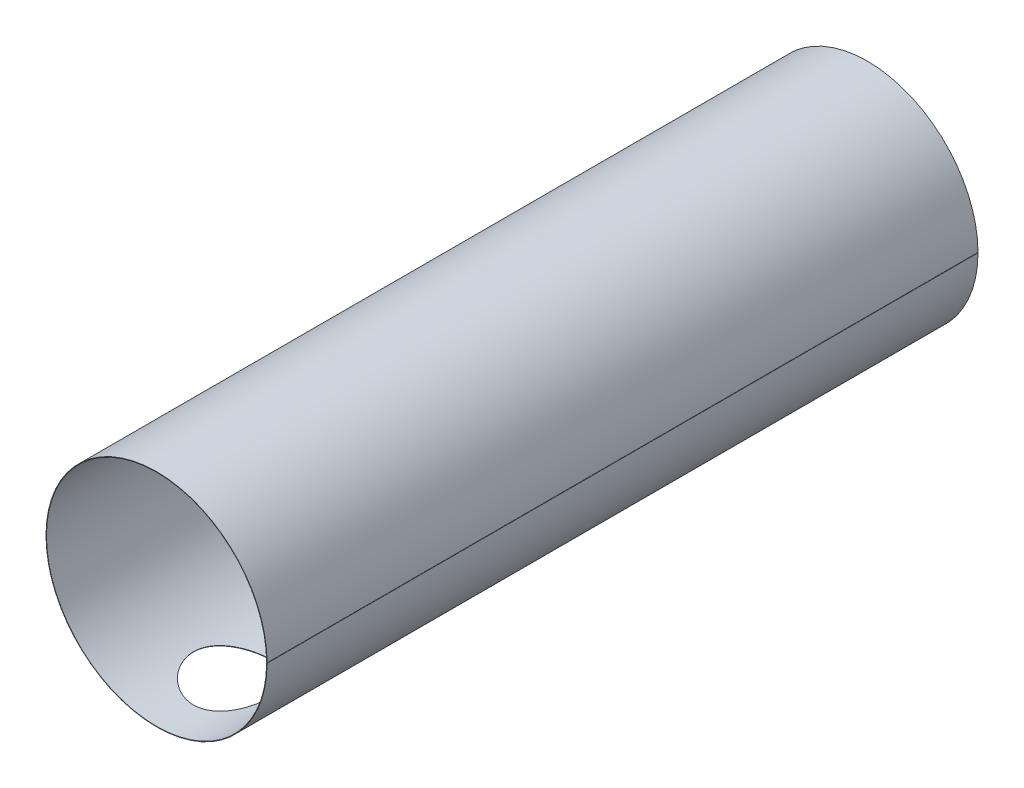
ISO-10303-21;
HEADER;
FILE_DESCRIPTION(('STEP AP214'),'2;1');
FILE_NAME('part.step','',(''),(''),'','','');
FILE_SCHEMA(('AUTOMOTIVE_DESIGN { 1 0 10303 214 1 1 1 1 }'));
ENDSEC;
DATA;
#1=APPLICATION_CONTEXT('core data for automotive mechanical design processes');
#2=APPLICATION_PROTOCOL_DEFINITION('international standard','automotive_design',2000,#1);
#3=PRODUCT_CONTEXT('',#1,'mechanical');
#4=PRODUCT('Part','Part','',(#3));
#5=PRODUCT_RELATED_PRODUCT_CATEGORY('part','',(#4));
#6=PRODUCT_DEFINITION_FORMATION('','',#4);
#7=PRODUCT_DEFINITION_CONTEXT('part definition',#1,'design');
#8=PRODUCT_DEFINITION('design','',#6,#7);
#9=PRODUCT_DEFINITION_SHAPE('','',#8);
#10=(LENGTH_UNIT() NAMED_UNIT(*) SI_UNIT(.MILLI.,.METRE.));
#11=(NAMED_UNIT(*) PLANE_ANGLE_UNIT() SI_UNIT($,.RADIAN.));
#12=(NAMED_UNIT(*) SI_UNIT($,.STERADIAN.) SOLID_ANGLE_UNIT());
#13=UNCERTAINTY_MEASURE_WITH_UNIT(LENGTH_MEASURE(1.E-05),#10,'distance_accuracy_value','');
#14=(GEOMETRIC_REPRESENTATION_CONTEXT(3) GLOBAL_UNCERTAINTY_ASSIGNED_CONTEXT((#13)) GLOBAL_UNIT_ASSIGNED_CONTEXT((#10,
#11,#12)) REPRESENTATION_CONTEXT('',''));
#15=CARTESIAN_POINT('',(0.,0.,0.));
#16=DIRECTION('',(0.,0.,1.));
#17=DIRECTION('',(1.,0.,0.));
#18=AXIS2_PLACEMENT_3D('',#15,#16,#17);
#19=CARTESIAN_POINT('',(507.997794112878,-0.499999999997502,3280.));
#20=DIRECTION('',(0.,1.,0.));
#21=DIRECTION('',(0.,0.,1.));
#22=AXIS2_PLACEMENT_3D('',#19,#20,#21);
#23=PLANE('',#22);
#24=DIRECTION('',(1.,0.,0.));
#25=VECTOR('',#24,1.);
#26=CARTESIAN_POINT('',(507.997794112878,-0.499999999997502,0.));
#27=LINE('',#26,#25);
#28=CARTESIAN_POINT('',(507.997794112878,-0.499999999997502,0.));
#29=VERTEX_POINT('',#28);
#30=CARTESIAN_POINT('',(509.997794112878,-0.499999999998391,0.));
#31=VERTEX_POINT('',#30);
#32=EDGE_CURVE('E412',#29,#31,#27,.T.);
#33=ORIENTED_EDGE('',*,*,#32,.F.);
#34=DIRECTION('',(0.,0.,-1.));
#35=VECTOR('',#34,1.);
#36=CARTESIAN_POINT('',(507.997794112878,-0.499999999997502,3280.));
#37=LINE('',#36,#35);
#38=CARTESIAN_POINT('',(507.997794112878,-0.499999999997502,3280.));
#39=VERTEX_POINT('',#38);
#40=EDGE_CURVE('E407',#39,#29,#37,.T.);
#41=ORIENTED_EDGE('',*,*,#40,.F.);
#42=DIRECTION('',(1.,0.,0.));
#43=VECTOR('',#42,1.);
#44=CARTESIAN_POINT('',(507.997794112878,-0.499999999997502,3280.));
#45=LINE('',#44,#43);
#46=CARTESIAN_POINT('',(509.997794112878,-0.499999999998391,3280.));
#47=VERTEX_POINT('',#46);
#48=EDGE_CURVE('E429',#39,#47,#45,.T.);
#49=ORIENTED_EDGE('',*,*,#48,.T.);
#50=DIRECTION('',(0.,0.,-1.));
#51=VECTOR('',#50,1.);
#52=CARTESIAN_POINT('',(509.997794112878,-0.499999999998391,3280.));
#53=LINE('',#52,#51);
#54=EDGE_CURVE('E427',#47,#31,#53,.T.);
#55=ORIENTED_EDGE('',*,*,#54,.T.);
#56=EDGE_LOOP('',(#33,#41,#49,#55));
#57=FACE_BOUND('',#56,.T.);
#58=ADVANCED_FACE('F83',(#57),#23,.T.);
#59=CARTESIAN_POINT('',(509.997794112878,-1.49999999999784,3280.));
#60=DIRECTION('',(1.,0.,0.));
#61=DIRECTION('',(0.,0.,-1.));
#62=AXIS2_PLACEMENT_3D('',#59,#60,#61);
#63=PLANE('',#62);
#64=DIRECTION('',(0.,-1.,0.));
#65=VECTOR('',#64,1.);
#66=CARTESIAN_POINT('',(509.997794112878,-1.49999999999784,0.));
#67=LINE('',#66,#65);
#68=CARTESIAN_POINT('',(509.997794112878,-1.4955817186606,0.));
#69=VERTEX_POINT('',#68);
#70=EDGE_CURVE('E418',#31,#69,#67,.T.);
#71=ORIENTED_EDGE('',*,*,#70,.F.);
#72=ORIENTED_EDGE('',*,*,#54,.F.);
#73=DIRECTION('',(0.,-1.,0.));
#74=VECTOR('',#73,1.);
#75=CARTESIAN_POINT('',(509.997794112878,-1.49999999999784,3280.));
#76=LINE('',#75,#74);
#77=CARTESIAN_POINT('',(509.997794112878,-1.4955817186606,3280.));
#78=VERTEX_POINT('',#77);
#79=EDGE_CURVE('E424',#47,#78,#76,.T.);
#80=ORIENTED_EDGE('',*,*,#79,.T.);
#81=DIRECTION('',(0.,0.,-1.));
#82=VECTOR('',#81,1.);
#83=CARTESIAN_POINT('',(509.997794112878,-1.4955817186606,3280.));
#84=LINE('',#83,#82);
#85=EDGE_CURVE('E421',#78,#69,#84,.T.);
#86=ORIENTED_EDGE('',*,*,#85,.T.);
#87=EDGE_LOOP('',(#71,#72,#80,#86));
#88=FACE_BOUND('',#87,.T.);
#89=ADVANCED_FACE('F447',(#88),#63,.T.);
#90=CARTESIAN_POINT('',(507.997789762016,-1.49853158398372,0.));
#91=DIRECTION('',(0.,0.,-1.));
#92=DIRECTION('',(-1.,0.,0.));
#93=AXIS2_PLACEMENT_3D('',#90,#91,#92);
#94=PLANE('',#93);
#95=ORIENTED_EDGE('',*,*,#70,.T.);
#96=DIRECTION('',(-1.,0.,0.));
#97=VECTOR('',#96,1.);
#98=CARTESIAN_POINT('',(509.997794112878,-1.4955817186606,0.));
#99=LINE('',#98,#97);
#100=CARTESIAN_POINT('',(507.997794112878,-1.49558171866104,0.));
#101=VERTEX_POINT('',#100);
#102=EDGE_CURVE('E415',#69,#101,#99,.T.);
#103=ORIENTED_EDGE('',*,*,#102,.T.);
#104=DIRECTION('',(0.,1.,0.));
#105=VECTOR('',#104,1.);
#106=CARTESIAN_POINT('',(507.997794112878,-1.49999999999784,0.));
#107=LINE('',#106,#105);
#108=EDGE_CURVE('E409',#29,#101,#107,.F.);
#109=ORIENTED_EDGE('',*,*,#108,.F.);
#110=ORIENTED_EDGE('',*,*,#32,.T.);
#111=EDGE_LOOP('',(#95,#103,#109,#110));
#112=FACE_BOUND('',#111,.T.);
#113=ADVANCED_FACE('F477',(#112),#94,.T.);
#114=CARTESIAN_POINT('',(507.997794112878,-1.49999999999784,3280.));
#115=DIRECTION('',(1.,0.,0.));
#116=DIRECTION('',(0.,0.,-1.));
#117=AXIS2_PLACEMENT_3D('',#114,#115,#116);
#118=PLANE('',#117);
#119=ORIENTED_EDGE('',*,*,#108,.T.);
#120=DIRECTION('',(0.,0.,-1.));
#121=VECTOR('',#120,1.);
#122=CARTESIAN_POINT('',(507.997794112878,-1.49558171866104,3280.));
#123=LINE('',#122,#121);
#124=CARTESIAN_POINT('',(507.997794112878,-1.49558171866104,3280.));
#125=VERTEX_POINT('',#124);
#126=EDGE_CURVE('E398',#125,#101,#123,.T.);
#127=ORIENTED_EDGE('',*,*,#126,.F.);
#128=DIRECTION('',(0.,1.,0.));
#129=VECTOR('',#128,1.);
#130=CARTESIAN_POINT('',(507.997794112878,-1.49999999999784,3280.));
#131=LINE('',#130,#129);
#132=EDGE_CURVE('E404',#39,#125,#131,.F.);
#133=ORIENTED_EDGE('',*,*,#132,.F.);
#134=ORIENTED_EDGE('',*,*,#40,.T.);
#135=EDGE_LOOP('',(#119,#127,#133,#134));
#136=FACE_BOUND('',#135,.T.);
#137=ADVANCED_FACE('F453',(#136),#118,.F.);
#138=CARTESIAN_POINT('',(506.997794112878,1.49558171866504,3280.));
#139=DIRECTION('',(0.,0.,-1.));
#140=DIRECTION('',(-1.,0.,0.));
#141=AXIS2_PLACEMENT_3D('',#138,#139,#140);
#142=PLANE('',#141);
#143=ORIENTED_EDGE('',*,*,#132,.T.);
#144=DIRECTION('',(1.,0.,0.));
#145=VECTOR('',#144,1.);
#146=CARTESIAN_POINT('',(507.997794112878,-1.49558171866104,3280.));
#147=LINE('',#146,#145);
#148=EDGE_CURVE('E401',#125,#78,#147,.T.);
#149=ORIENTED_EDGE('',*,*,#148,.T.);
#150=ORIENTED_EDGE('',*,*,#79,.F.);
#151=ORIENTED_EDGE('',*,*,#48,.F.);
#152=EDGE_LOOP('',(#143,#149,#150,#151));
#153=FACE_BOUND('',#152,.T.);
#154=ADVANCED_FACE('F85',(#153),#142,.F.);
#155=CARTESIAN_POINT('',(506.997794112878,-1.49558171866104,3280.));
#156=DIRECTION('',(0.,0.,1.));
#157=DIRECTION('',(1.,0.,0.));
#158=AXIS2_PLACEMENT_3D('',#155,#156,#157);
#159=PLANE('',#158);
#160=ORIENTED_EDGE('',*,*,#148,.F.);
#161=CARTESIAN_POINT('',(506.997794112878,-1.49558171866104,3280.));
#162=DIRECTION('',(0.,0.,-1.));
#163=DIRECTION('',(-1.,0.,0.));
#164=AXIS2_PLACEMENT_3D('',#161,#162,#163);
#165=CIRCLE('',#164,1.);
#166=CARTESIAN_POINT('',(507.997789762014,-1.49853158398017,3280.));
#167=VERTEX_POINT('',#166);
#168=EDGE_CURVE('E106',#125,#167,#165,.T.);
#169=ORIENTED_EDGE('',*,*,#168,.T.);
#170=DIRECTION('',(-0.999995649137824,0.00294986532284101,0.));
#171=VECTOR('',#170,1.);
#172=CARTESIAN_POINT('',(509.997781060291,-1.50443131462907,3280.));
#173=LINE('',#172,#171);
#174=CARTESIAN_POINT('',(509.997781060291,-1.50443131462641,3280.));
#175=VERTEX_POINT('',#174);
#176=EDGE_CURVE('E434',#175,#167,#173,.T.);
#177=ORIENTED_EDGE('',*,*,#176,.F.);
#178=CARTESIAN_POINT('',(506.997794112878,-1.49558171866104,3280.));
#179=DIRECTION('',(0.,0.,-1.));
#180=DIRECTION('',(-1.,0.,0.));
#181=AXIS2_PLACEMENT_3D('',#178,#179,#180);
#182=CIRCLE('',#181,2.99999999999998);
#183=EDGE_CURVE('E393',#78,#175,#182,.T.);
#184=ORIENTED_EDGE('',*,*,#183,.F.);
#185=EDGE_LOOP('',(#160,#169,#177,#184));
#186=FACE_BOUND('',#185,.T.);
#187=ADVANCED_FACE('F440',(#186),#159,.T.);
#188=CARTESIAN_POINT('',(506.997794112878,-1.49558171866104,0.));
#189=DIRECTION('',(0.,0.,-1.));
#190=DIRECTION('',(-1.,0.,0.));
#191=AXIS2_PLACEMENT_3D('',#188,#189,#190);
#192=PLANE('',#191);
#193=DIRECTION('',(0.999995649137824,-0.00294986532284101,0.));
#194=VECTOR('',#193,1.);
#195=CARTESIAN_POINT('',(507.997789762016,-1.49853158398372,0.));
#196=LINE('',#195,#194);
#197=CARTESIAN_POINT('',(507.997789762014,-1.49853158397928,0.));
#198=VERTEX_POINT('',#197);
#199=CARTESIAN_POINT('',(509.99778106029,-1.50443131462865,0.));
#200=VERTEX_POINT('',#199);
#201=EDGE_CURVE('E12',#198,#200,#196,.T.);
#202=ORIENTED_EDGE('',*,*,#201,.F.);
#203=CARTESIAN_POINT('',(506.997794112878,-1.49558171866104,9.04576887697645E-13));
#204=DIRECTION('',(0.,0.,-1.));
#205=DIRECTION('',(-1.,0.,0.));
#206=AXIS2_PLACEMENT_3D('',#203,#204,#205);
#207=CIRCLE('',#206,1.);
#208=EDGE_CURVE('E98',#198,#101,#207,.F.);
#209=ORIENTED_EDGE('',*,*,#208,.T.);
#210=ORIENTED_EDGE('',*,*,#102,.F.);
#211=CARTESIAN_POINT('',(506.997794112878,-1.49558171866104,0.));
#212=DIRECTION('',(0.,0.,1.));
#213=DIRECTION('',(1.,0.,0.));
#214=AXIS2_PLACEMENT_3D('',#211,#212,#213);
#215=CIRCLE('',#214,2.99999999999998);
#216=EDGE_CURVE('E395',#200,#69,#215,.T.);
#217=ORIENTED_EDGE('',*,*,#216,.F.);
#218=EDGE_LOOP('',(#202,#209,#210,#217));
#219=FACE_BOUND('',#218,.T.);
#220=ADVANCED_FACE('F456',(#219),#192,.T.);
#221=CARTESIAN_POINT('',(506.997794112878,-1.49558171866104,4920.00060976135));
#222=DIRECTION('',(0.,0.,-1.));
#223=DIRECTION('',(-1.,0.,0.));
#224=AXIS2_PLACEMENT_3D('',#221,#222,#223);
#225=CYLINDRICAL_SURFACE('',#224,3.);
#226=ORIENTED_EDGE('',*,*,#216,.T.);
#227=ORIENTED_EDGE('',*,*,#85,.F.);
#228=ORIENTED_EDGE('',*,*,#183,.T.);
#229=DIRECTION('',(0.,0.,-1.));
#230=VECTOR('',#229,1.);
#231=CARTESIAN_POINT('',(509.997781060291,-1.50443131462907,3280.));
#232=LINE('',#231,#230);
#233=EDGE_CURVE('E226',#175,#200,#232,.T.);
#234=ORIENTED_EDGE('',*,*,#233,.T.);
#235=EDGE_LOOP('',(#226,#227,#228,#234));
#236=FACE_BOUND('',#235,.T.);
#237=ADVANCED_FACE('F443',(#236),#225,.T.);
#238=CARTESIAN_POINT('',(506.997794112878,-1.49558171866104,4920.00060976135));
#239=DIRECTION('',(0.,0.,-1.));
#240=DIRECTION('',(-1.,0.,0.));
#241=AXIS2_PLACEMENT_3D('',#238,#239,#240);
#242=CYLINDRICAL_SURFACE('',#241,1.);
#243=ORIENTED_EDGE('',*,*,#208,.F.);
#244=DIRECTION('',(0.,0.,-1.));
#245=VECTOR('',#244,1.);
#246=CARTESIAN_POINT('',(507.997789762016,-1.49853158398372,3280.));
#247=LINE('',#246,#245);
#248=EDGE_CURVE('E91',#167,#198,#247,.T.);
#249=ORIENTED_EDGE('',*,*,#248,.F.);
#250=ORIENTED_EDGE('',*,*,#168,.F.);
#251=ORIENTED_EDGE('',*,*,#126,.T.);
#252=EDGE_LOOP('',(#243,#249,#250,#251));
#253=FACE_BOUND('',#252,.T.);
#254=ADVANCED_FACE('F439',(#253),#242,.F.);
#255=CARTESIAN_POINT('',(509.997794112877,0.499999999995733,3280.));
#256=DIRECTION('',(0.,-1.,0.));
#257=DIRECTION('',(0.,0.,-1.));
#258=AXIS2_PLACEMENT_3D('',#255,#256,#257);
#259=PLANE('',#258);
#260=DIRECTION('',(-1.,0.,0.));
#261=VECTOR('',#260,1.);
#262=CARTESIAN_POINT('',(509.997794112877,0.499999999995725,0.));
#263=LINE('',#262,#261);
#264=CARTESIAN_POINT('',(509.997794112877,0.499999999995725,0.));
#265=VERTEX_POINT('',#264);
#266=CARTESIAN_POINT('',(507.997794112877,0.499999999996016,0.));
#267=VERTEX_POINT('',#266);
#268=EDGE_CURVE('E379',#265,#267,#263,.T.);
#269=ORIENTED_EDGE('',*,*,#268,.F.);
#270=DIRECTION('',(0.,0.,-1.));
#271=VECTOR('',#270,1.);
#272=CARTESIAN_POINT('',(509.997794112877,0.499999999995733,3280.));
#273=LINE('',#272,#271);
#274=CARTESIAN_POINT('',(509.997794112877,0.499999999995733,3280.));
#275=VERTEX_POINT('',#274);
#276=EDGE_CURVE('E365',#275,#265,#273,.T.);
#277=ORIENTED_EDGE('',*,*,#276,.F.);
#278=DIRECTION('',(-1.,0.,0.));
#279=VECTOR('',#278,1.);
#280=CARTESIAN_POINT('',(509.997794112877,0.499999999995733,3280.));
#281=LINE('',#280,#279);
#282=CARTESIAN_POINT('',(507.997794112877,0.499999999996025,3280.));
#283=VERTEX_POINT('',#282);
#284=EDGE_CURVE('E221',#275,#283,#281,.T.);
#285=ORIENTED_EDGE('',*,*,#284,.T.);
#286=DIRECTION('',(0.,0.,-1.));
#287=VECTOR('',#286,1.);
#288=CARTESIAN_POINT('',(507.997794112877,0.499999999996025,3280.));
#289=LINE('',#288,#287);
#290=EDGE_CURVE('E387',#283,#267,#289,.T.);
#291=ORIENTED_EDGE('',*,*,#290,.T.);
#292=EDGE_LOOP('',(#269,#277,#285,#291));
#293=FACE_BOUND('',#292,.T.);
#294=ADVANCED_FACE('F501',(#293),#259,.T.);
#295=CARTESIAN_POINT('',(506.997794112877,1.49558171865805,0.));
#296=DIRECTION('',(0.,0.,-1.));
#297=DIRECTION('',(-1.,0.,0.));
#298=AXIS2_PLACEMENT_3D('',#295,#296,#297);
#299=PLANE('',#298);
#300=DIRECTION('',(0.,1.,0.));
#301=VECTOR('',#300,1.);
#302=CARTESIAN_POINT('',(507.997794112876,1.49999999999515,0.));
#303=LINE('',#302,#301);
#304=CARTESIAN_POINT('',(507.997794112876,1.49558171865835,0.));
#305=VERTEX_POINT('',#304);
#306=EDGE_CURVE('E376',#305,#267,#303,.F.);
#307=ORIENTED_EDGE('',*,*,#306,.F.);
#308=DIRECTION('',(1.,0.,0.));
#309=VECTOR('',#308,1.);
#310=CARTESIAN_POINT('',(507.997794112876,1.49558171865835,0.));
#311=LINE('',#310,#309);
#312=CARTESIAN_POINT('',(509.997794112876,1.49558171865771,8.88178419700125E-13));
#313=VERTEX_POINT('',#312);
#314=EDGE_CURVE('E385',#305,#313,#311,.T.);
#315=ORIENTED_EDGE('',*,*,#314,.T.);
#316=DIRECTION('',(0.,-1.,0.));
#317=VECTOR('',#316,1.);
#318=CARTESIAN_POINT('',(509.997794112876,1.49999999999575,0.));
#319=LINE('',#318,#317);
#320=EDGE_CURVE('E382',#313,#265,#319,.T.);
#321=ORIENTED_EDGE('',*,*,#320,.T.);
#322=ORIENTED_EDGE('',*,*,#268,.T.);
#323=EDGE_LOOP('',(#307,#315,#321,#322));
#324=FACE_BOUND('',#323,.T.);
#325=ADVANCED_FACE('F525',(#324),#299,.T.);
#326=CARTESIAN_POINT('',(507.997794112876,1.49999999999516,3280.));
#327=DIRECTION('',(1.,0.,0.));
#328=DIRECTION('',(0.,0.,-1.));
#329=AXIS2_PLACEMENT_3D('',#326,#327,#328);
#330=PLANE('',#329);
#331=ORIENTED_EDGE('',*,*,#306,.T.);
#332=ORIENTED_EDGE('',*,*,#290,.F.);
#333=DIRECTION('',(0.,1.,0.));
#334=VECTOR('',#333,1.);
#335=CARTESIAN_POINT('',(507.997794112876,1.49999999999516,3280.));
#336=LINE('',#335,#334);
#337=CARTESIAN_POINT('',(507.997794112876,1.49558171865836,3280.));
#338=VERTEX_POINT('',#337);
#339=EDGE_CURVE('E370',#338,#283,#336,.F.);
#340=ORIENTED_EDGE('',*,*,#339,.F.);
#341=DIRECTION('',(0.,0.,-1.));
#342=VECTOR('',#341,1.);
#343=CARTESIAN_POINT('',(507.997794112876,1.49558171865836,3280.));
#344=LINE('',#343,#342);
#345=EDGE_CURVE('E373',#338,#305,#344,.T.);
#346=ORIENTED_EDGE('',*,*,#345,.T.);
#347=EDGE_LOOP('',(#331,#332,#340,#346));
#348=FACE_BOUND('',#347,.T.);
#349=ADVANCED_FACE('F521',(#348),#330,.F.);
#350=CARTESIAN_POINT('',(507.997789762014,1.4985315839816,3280.));
#351=DIRECTION('',(0.,0.,1.));
#352=DIRECTION('',(1.,0.,0.));
#353=AXIS2_PLACEMENT_3D('',#350,#351,#352);
#354=PLANE('',#353);
#355=DIRECTION('',(0.,-1.,0.));
#356=VECTOR('',#355,1.);
#357=CARTESIAN_POINT('',(509.997794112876,1.49999999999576,3280.));
#358=LINE('',#357,#356);
#359=CARTESIAN_POINT('',(509.997794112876,1.49558171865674,3280.));
#360=VERTEX_POINT('',#359);
#361=EDGE_CURVE('E367',#360,#275,#358,.T.);
#362=ORIENTED_EDGE('',*,*,#361,.F.);
#363=DIRECTION('',(-1.,0.,0.));
#364=VECTOR('',#363,1.);
#365=CARTESIAN_POINT('',(509.997794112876,1.49558171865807,3280.));
#366=LINE('',#365,#364);
#367=EDGE_CURVE('E194',#360,#338,#366,.T.);
#368=ORIENTED_EDGE('',*,*,#367,.T.);
#369=ORIENTED_EDGE('',*,*,#339,.T.);
#370=ORIENTED_EDGE('',*,*,#284,.F.);
#371=EDGE_LOOP('',(#362,#368,#369,#370));
#372=FACE_BOUND('',#371,.T.);
#373=ADVANCED_FACE('F517',(#372),#354,.T.);
#374=CARTESIAN_POINT('',(509.997794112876,1.49999999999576,3280.));
#375=DIRECTION('',(1.,0.,0.));
#376=DIRECTION('',(0.,0.,-1.));
#377=AXIS2_PLACEMENT_3D('',#374,#375,#376);
#378=PLANE('',#377);
#379=ORIENTED_EDGE('',*,*,#320,.F.);
#380=DIRECTION('',(0.,0.,-1.));
#381=VECTOR('',#380,1.);
#382=CARTESIAN_POINT('',(509.997794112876,1.49558171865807,3280.));
#383=LINE('',#382,#381);
#384=EDGE_CURVE('E197',#360,#313,#383,.T.);
#385=ORIENTED_EDGE('',*,*,#384,.F.);
#386=ORIENTED_EDGE('',*,*,#361,.T.);
#387=ORIENTED_EDGE('',*,*,#276,.T.);
#388=EDGE_LOOP('',(#379,#385,#386,#387));
#389=FACE_BOUND('',#388,.T.);
#390=ADVANCED_FACE('F514',(#389),#378,.T.);
#391=CARTESIAN_POINT('',(506.997794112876,1.49558171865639,4920.00060978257));
#392=DIRECTION('',(0.,0.,-1.));
#393=DIRECTION('',(0.,1.,0.));
#394=AXIS2_PLACEMENT_3D('',#391,#392,#393);
#395=CYLINDRICAL_SURFACE('',#394,3.);
#396=CARTESIAN_POINT('',(506.997794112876,1.49558171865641,0.));
#397=DIRECTION('',(0.,0.,1.));
#398=DIRECTION('',(1.,0.,0.));
#399=AXIS2_PLACEMENT_3D('',#396,#397,#398);
#400=CIRCLE('',#399,2.99999999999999);
#401=CARTESIAN_POINT('',(509.99778106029,1.50443131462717,0.));
#402=VERTEX_POINT('',#401);
#403=EDGE_CURVE('E198',#313,#402,#400,.T.);
#404=ORIENTED_EDGE('',*,*,#403,.T.);
#405=DIRECTION('',(0.,0.,-1.));
#406=VECTOR('',#405,1.);
#407=CARTESIAN_POINT('',(509.99778106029,1.50443131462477,3280.));
#408=LINE('',#407,#406);
#409=CARTESIAN_POINT('',(509.99778106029,1.50443131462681,3280.));
#410=VERTEX_POINT('',#409);
#411=EDGE_CURVE('E201',#410,#402,#408,.T.);
#412=ORIENTED_EDGE('',*,*,#411,.F.);
#413=CARTESIAN_POINT('',(506.997794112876,1.49558171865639,3280.));
#414=DIRECTION('',(0.,0.,-1.));
#415=DIRECTION('',(-1.,0.,0.));
#416=AXIS2_PLACEMENT_3D('',#413,#414,#415);
#417=CIRCLE('',#416,2.99999999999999);
#418=EDGE_CURVE('E186',#410,#360,#417,.T.);
#419=ORIENTED_EDGE('',*,*,#418,.T.);
#420=ORIENTED_EDGE('',*,*,#384,.T.);
#421=EDGE_LOOP('',(#404,#412,#419,#420));
#422=FACE_BOUND('',#421,.T.);
#423=ADVANCED_FACE('F202',(#422),#395,.T.);
#424=CARTESIAN_POINT('',(506.997794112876,1.49558171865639,3280.));
#425=DIRECTION('',(0.,0.,1.));
#426=DIRECTION('',(1.,0.,0.));
#427=AXIS2_PLACEMENT_3D('',#424,#425,#426);
#428=PLANE('',#427);
#429=DIRECTION('',(0.999995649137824,0.00294986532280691,0.));
#430=VECTOR('',#429,1.);
#431=CARTESIAN_POINT('',(507.997789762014,1.4985315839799,3280.));
#432=LINE('',#431,#430);
#433=CARTESIAN_POINT('',(507.997789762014,1.4985315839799,3280.));
#434=VERTEX_POINT('',#433);
#435=EDGE_CURVE('E191',#434,#410,#432,.T.);
#436=ORIENTED_EDGE('',*,*,#435,.F.);
#437=CARTESIAN_POINT('',(506.997794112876,1.49558171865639,3280.));
#438=DIRECTION('',(0.,0.,-1.));
#439=DIRECTION('',(0.,1.,0.));
#440=AXIS2_PLACEMENT_3D('',#437,#438,#439);
#441=CIRCLE('',#440,1.);
#442=EDGE_CURVE('E361',#434,#338,#441,.T.);
#443=ORIENTED_EDGE('',*,*,#442,.T.);
#444=ORIENTED_EDGE('',*,*,#367,.F.);
#445=ORIENTED_EDGE('',*,*,#418,.F.);
#446=EDGE_LOOP('',(#436,#443,#444,#445));
#447=FACE_BOUND('',#446,.T.);
#448=ADVANCED_FACE('F188',(#447),#428,.T.);
#449=CARTESIAN_POINT('',(506.997794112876,1.49558171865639,4920.00060978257));
#450=DIRECTION('',(0.,0.,-1.));
#451=DIRECTION('',(0.,1.,0.));
#452=AXIS2_PLACEMENT_3D('',#449,#450,#451);
#453=CYLINDRICAL_SURFACE('',#452,1.);
#454=CARTESIAN_POINT('',(506.997794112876,1.49558171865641,8.88178419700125E-13));
#455=DIRECTION('',(0.,0.,-1.));
#456=DIRECTION('',(0.,1.,0.));
#457=AXIS2_PLACEMENT_3D('',#454,#455,#456);
#458=CIRCLE('',#457,1.);
#459=CARTESIAN_POINT('',(507.997789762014,1.4985315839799,0.));
#460=VERTEX_POINT('',#459);
#461=EDGE_CURVE('E351',#305,#460,#458,.F.);
#462=ORIENTED_EDGE('',*,*,#461,.F.);
#463=ORIENTED_EDGE('',*,*,#345,.F.);
#464=ORIENTED_EDGE('',*,*,#442,.F.);
#465=DIRECTION('',(0.,0.,-1.));
#466=VECTOR('',#465,1.);
#467=CARTESIAN_POINT('',(507.997789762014,1.4985315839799,3280.));
#468=LINE('',#467,#466);
#469=EDGE_CURVE('E358',#434,#460,#468,.T.);
#470=ORIENTED_EDGE('',*,*,#469,.T.);
#471=EDGE_LOOP('',(#462,#463,#464,#470));
#472=FACE_BOUND('',#471,.T.);
#473=ADVANCED_FACE('F505',(#472),#453,.F.);
#474=CARTESIAN_POINT('',(506.997794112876,1.49558171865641,0.));
#475=DIRECTION('',(0.,0.,-1.));
#476=DIRECTION('',(-1.,0.,0.));
#477=AXIS2_PLACEMENT_3D('',#474,#475,#476);
#478=PLANE('',#477);
#479=ORIENTED_EDGE('',*,*,#314,.F.);
#480=ORIENTED_EDGE('',*,*,#461,.T.);
#481=DIRECTION('',(-0.999995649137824,-0.00294986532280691,0.));
#482=VECTOR('',#481,1.);
#483=CARTESIAN_POINT('',(509.99778106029,1.50443131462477,0.));
#484=LINE('',#483,#482);
#485=EDGE_CURVE('E209',#402,#460,#484,.T.);
#486=ORIENTED_EDGE('',*,*,#485,.F.);
#487=ORIENTED_EDGE('',*,*,#403,.F.);
#488=EDGE_LOOP('',(#479,#480,#486,#487));
#489=FACE_BOUND('',#488,.T.);
#490=ADVANCED_FACE('F310',(#489),#478,.T.);
#491=CARTESIAN_POINT('',(-0.0399431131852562,-509.999998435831,2749.00000414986));
#492=CARTESIAN_POINT('',(-6.58483038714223,-509.999485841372,2749.11434029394));
#493=CARTESIAN_POINT('',(-12.8143025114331,-509.873295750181,2749.46199127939));
#494=CARTESIAN_POINT('',(-21.6804201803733,-509.54754969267,2750.3334461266));
#495=CARTESIAN_POINT('',(-24.556131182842,-509.416171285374,2750.68226046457));
#496=CARTESIAN_POINT('',(-28.7498580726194,-509.190932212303,2751.29297605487));
#497=CARTESIAN_POINT('',(-30.1277957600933,-509.111153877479,2751.51113026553));
#498=CARTESIAN_POINT('',(-32.1647187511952,-508.9851605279,2751.86023510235));
#499=CARTESIAN_POINT('',(-32.838695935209,-508.942108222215,2751.9802489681));
#500=CARTESIAN_POINT('',(-33.8421636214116,-508.876036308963,2752.16573814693));
#501=CARTESIAN_POINT('',(-34.1754031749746,-508.853763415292,2752.2284792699));
#502=CARTESIAN_POINT('',(-34.6733877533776,-508.81999161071,2752.32395804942));
#503=CARTESIAN_POINT('',(-34.839070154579,-508.808673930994,2752.35601215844));
#504=CARTESIAN_POINT('',(-35.0871250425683,-508.79160815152,2752.40443509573));
#505=CARTESIAN_POINT('',(-35.169731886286,-508.78590468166,2752.42063303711));
#506=CARTESIAN_POINT('',(-35.2935249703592,-508.777327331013,2752.44501539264));
#507=CARTESIAN_POINT('',(-35.3347698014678,-508.774464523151,2752.45315708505));
#508=CARTESIAN_POINT('',(-35.3966077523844,-508.77016479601,2752.46539098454));
#509=CARTESIAN_POINT('',(-35.4172155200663,-508.768730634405,2752.46947251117));
#510=CARTESIAN_POINT('',(-35.4584212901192,-508.765860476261,2752.47764268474));
#511=CARTESIAN_POINT('',(-35.4771078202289,-508.764557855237,2752.48135148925));
#512=CARTESIAN_POINT('',(-41.2607879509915,-508.360993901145,2753.6306682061));
#513=CARTESIAN_POINT('',(-46.971232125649,-507.86420208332,2755.06406081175));
#514=CARTESIAN_POINT('',(-55.4565109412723,-506.983886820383,2757.64697162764));
#515=CARTESIAN_POINT('',(-58.2715440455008,-506.667927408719,2758.58007888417));
#516=CARTESIAN_POINT('',(-62.4735097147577,-506.161091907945,2760.08794524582));
#517=CARTESIAN_POINT('',(-63.8707345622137,-505.986664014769,2760.60860161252));
#518=CARTESIAN_POINT('',(-65.9613670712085,-505.716908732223,2761.41663753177));
#519=CARTESIAN_POINT('',(-66.6573771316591,-505.625638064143,2761.69049139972));
#520=CARTESIAN_POINT('',(-67.7000838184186,-505.486717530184,2762.10803504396));
#521=CARTESIAN_POINT('',(-68.0474346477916,-505.440074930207,2762.24834339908));
#522=CARTESIAN_POINT('',(-68.5681328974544,-505.369609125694,2762.46049664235));
#523=CARTESIAN_POINT('',(-68.7416443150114,-505.34603687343,2762.53149617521));
#524=CARTESIAN_POINT('',(-69.088557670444,-505.298725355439,2762.6740588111));
#525=CARTESIAN_POINT('',(-69.2633783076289,-505.274791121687,2762.74620990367));
#526=CARTESIAN_POINT('',(-80.4387259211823,-503.738993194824,2767.37790831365));
#527=CARTESIAN_POINT('',(-90.7963389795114,-501.950326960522,2772.89388955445));
#528=CARTESIAN_POINT('',(-105.362236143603,-499.022369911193,2782.60117100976));
#529=CARTESIAN_POINT('',(-110.055969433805,-498.005345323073,2786.07581642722));
#530=CARTESIAN_POINT('',(-116.855439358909,-496.437525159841,2791.64611195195));
#531=CARTESIAN_POINT('',(-119.081749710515,-495.907857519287,2793.56259835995));
#532=CARTESIAN_POINT('',(-122.361169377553,-495.105050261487,2796.52690982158));
#533=CARTESIAN_POINT('',(-123.444302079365,-494.836062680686,2797.52994395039));
#534=CARTESIAN_POINT('',(-125.054022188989,-494.430781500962,2799.05689060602));
#535=CARTESIAN_POINT('',(-125.588099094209,-494.295387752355,2799.56960540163));
#536=CARTESIAN_POINT('',(-126.385473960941,-494.091881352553,2800.34427646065));
#537=CARTESIAN_POINT('',(-126.650642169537,-494.023976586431,2800.60343329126));
#538=CARTESIAN_POINT('',(-127.047459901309,-493.922019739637,2800.99356825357));
#539=CARTESIAN_POINT('',(-127.179576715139,-493.888017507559,2801.12384652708));
#540=CARTESIAN_POINT('',(-127.44349890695,-493.819980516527,2801.38486964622));
#541=CARTESIAN_POINT('',(-127.574125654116,-493.786250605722,2801.5144418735));
#542=CARTESIAN_POINT('',(-136.207967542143,-491.553141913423,2810.10424062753));
#543=CARTESIAN_POINT('',(-143.694945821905,-489.385384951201,2819.17049897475));
#544=CARTESIAN_POINT('',(-153.448105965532,-486.379740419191,2833.68280201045));
#545=CARTESIAN_POINT('',(-156.452993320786,-485.418289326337,2838.6723889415));
#546=CARTESIAN_POINT('',(-160.596558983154,-484.056669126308,2846.38499821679));
#547=CARTESIAN_POINT('',(-161.917117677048,-483.616187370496,2848.99390612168));
#548=CARTESIAN_POINT('',(-163.807664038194,-482.977734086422,2852.96432519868));
#549=CARTESIAN_POINT('',(-164.422797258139,-482.76862576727,2854.29730776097));
#550=CARTESIAN_POINT('',(-165.323002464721,-482.460781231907,2856.31104590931));
#551=CARTESIAN_POINT('',(-165.619321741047,-482.359135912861,2856.98466934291));
#552=CARTESIAN_POINT('',(-166.058186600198,-482.208152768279,2857.99867056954));
#553=CARTESIAN_POINT('',(-166.203539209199,-482.158072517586,2858.33726532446));
#554=CARTESIAN_POINT('',(-166.420165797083,-482.083327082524,2858.84604897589));
#555=CARTESIAN_POINT('',(-166.492140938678,-482.058474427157,2859.01579211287));
#556=CARTESIAN_POINT('',(-166.599753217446,-482.021289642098,2859.27062969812));
#557=CARTESIAN_POINT('',(-166.635565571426,-482.008910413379,2859.35561270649));
#558=CARTESIAN_POINT('',(-166.707073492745,-481.984183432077,2859.5256530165));
#559=CARTESIAN_POINT('',(-166.741928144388,-481.972126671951,2859.60870238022));
#560=CARTESIAN_POINT('',(-171.447603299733,-480.343763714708,2870.84491019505));
#561=CARTESIAN_POINT('',(-174.926892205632,-479.068556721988,2882.19661865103));
#562=CARTESIAN_POINT('',(-178.400594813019,-477.781071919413,2899.52808587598));
#563=CARTESIAN_POINT('',(-179.267396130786,-477.455318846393,2905.35589237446));
#564=CARTESIAN_POINT('',(-180.422308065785,-477.020095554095,2917.11280688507));
#565=CARTESIAN_POINT('',(-180.710422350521,-476.910623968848,2923.04333568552));
#566=CARTESIAN_POINT('',(-180.708521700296,-476.911344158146,2940.97834962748));
#567=CARTESIAN_POINT('',(-179.553322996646,-477.353871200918,2952.7335365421));
#568=CARTESIAN_POINT('',(-176.07547455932,-478.642826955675,2970.06408334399));
#569=CARTESIAN_POINT('',(-174.625053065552,-479.175885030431,2975.79056001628));
#570=CARTESIAN_POINT('',(-172.008465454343,-480.118680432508,2984.3047166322));
#571=CARTESIAN_POINT('',(-171.062760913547,-480.456763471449,2987.13017577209));
#572=CARTESIAN_POINT('',(-169.533275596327,-480.997672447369,2991.3494748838));
#573=CARTESIAN_POINT('',(-169.004958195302,-481.183602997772,2992.75275965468));
#574=CARTESIAN_POINT('',(-168.184657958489,-481.470668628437,2994.85296441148));
#575=CARTESIAN_POINT('',(-167.906587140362,-481.567718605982,2995.55224559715));
#576=CARTESIAN_POINT('',(-167.482513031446,-481.715299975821,2996.59998677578));
#577=CARTESIAN_POINT('',(-167.339993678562,-481.764828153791,2996.94903706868));
#578=CARTESIAN_POINT('',(-167.124471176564,-481.839617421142,2997.47231735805));
#579=CARTESIAN_POINT('',(-167.052339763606,-481.864630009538,2997.64669492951));
#580=CARTESIAN_POINT('',(-166.943706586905,-481.90227256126,2997.90818749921));
#581=CARTESIAN_POINT('',(-166.907422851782,-481.914840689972,2997.9953393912));
#582=CARTESIAN_POINT('',(-166.834709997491,-481.940018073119,2998.16961857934));
#583=CARTESIAN_POINT('',(-166.797420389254,-481.952925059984,2998.25879951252));
#584=CARTESIAN_POINT('',(-162.199687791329,-483.543757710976,3009.2317151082));
#585=CARTESIAN_POINT('',(-156.680623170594,-485.383874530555,3019.51227768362));
#586=CARTESIAN_POINT('',(-146.924083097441,-488.390104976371,3034.02218405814));
#587=CARTESIAN_POINT('',(-143.425503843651,-489.432648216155,3038.70699660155));
#588=CARTESIAN_POINT('',(-137.802454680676,-491.033890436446,3045.50648104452));
#589=CARTESIAN_POINT('',(-135.865575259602,-491.573840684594,3047.73502013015));
#590=CARTESIAN_POINT('',(-132.865782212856,-492.389843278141,3051.02089516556));
#591=CARTESIAN_POINT('',(-131.85010575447,-492.662854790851,3052.10669791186));
#592=CARTESIAN_POINT('',(-130.302890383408,-493.0734645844,3053.72116863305));
#593=CARTESIAN_POINT('',(-129.783201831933,-493.210516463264,3054.25695330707));
#594=CARTESIAN_POINT('',(-128.997733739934,-493.416313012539,3055.05707196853));
#595=CARTESIAN_POINT('',(-128.734921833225,-493.484948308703,3055.32318513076));
#596=CARTESIAN_POINT('',(-128.339218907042,-493.587949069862,3055.7214652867));
#597=CARTESIAN_POINT('',(-128.207070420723,-493.622290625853,3055.85407707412));
#598=CARTESIAN_POINT('',(-127.942278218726,-493.690988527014,3056.11900411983));
#599=CARTESIAN_POINT('',(-127.808373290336,-493.725670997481,3056.25257371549));
#600=CARTESIAN_POINT('',(-119.252408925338,-495.938078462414,3064.76189637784));
#601=CARTESIAN_POINT('',(-110.188429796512,-498.052853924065,3072.18573116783));
#602=CARTESIAN_POINT('',(-95.6201665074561,-500.980356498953,3081.88962052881));
#603=CARTESIAN_POINT('',(-90.6021462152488,-501.915191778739,3084.8856065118));
#604=CARTESIAN_POINT('',(-82.8319005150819,-503.235311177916,3089.02161978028));
#605=CARTESIAN_POINT('',(-80.2012929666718,-503.661648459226,3090.34062991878));
#606=CARTESIAN_POINT('',(-76.1946536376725,-504.277900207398,3092.22965370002));
#607=CARTESIAN_POINT('',(-74.8489865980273,-504.479440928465,3092.84441305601));
#608=CARTESIAN_POINT('',(-72.8153195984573,-504.775592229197,3093.74417923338));
#609=CARTESIAN_POINT('',(-72.1349029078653,-504.873282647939,3094.04037248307));
#610=CARTESIAN_POINT('',(-71.1104885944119,-505.01823466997,3094.47906914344));
#611=CARTESIAN_POINT('',(-70.7683856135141,-505.066288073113,3094.62436916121));
#612=CARTESIAN_POINT('',(-70.2542841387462,-505.13796679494,3094.84092088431));
#613=CARTESIAN_POINT('',(-70.0827591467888,-505.16179280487,3094.91287174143));
#614=CARTESIAN_POINT('',(-69.7393935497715,-505.209310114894,3095.05630735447));
#615=CARTESIAN_POINT('',(-69.5690514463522,-505.232795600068,3095.12717134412));
#616=CARTESIAN_POINT('',(-58.2917539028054,-506.78170021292,3099.79888199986));
#617=CARTESIAN_POINT('',(-46.9426139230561,-507.967492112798,3103.24888260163));
#618=CARTESIAN_POINT('',(-29.5830870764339,-509.174318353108,3106.69912713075));
#619=CARTESIAN_POINT('',(-23.740691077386,-509.481279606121,3107.56174924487));
#620=CARTESIAN_POINT('',(-14.8980569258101,-509.79088513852,3108.42449332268));
#621=CARTESIAN_POINT('',(-11.9373443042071,-509.868947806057,3108.64020983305));
#622=CARTESIAN_POINT('',(-7.47717212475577,-509.947353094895,3108.85598732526));
#623=CARTESIAN_POINT('',(-5.98726454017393,-509.967040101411,3108.90994694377));
#624=CARTESIAN_POINT('',(-3.74771212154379,-509.986776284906,3108.9639370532));
#625=CARTESIAN_POINT('',(-3.00041283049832,-509.991722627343,3108.97744220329));
#626=CARTESIAN_POINT('',(-1.87830189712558,-509.996678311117,3108.99096259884));
#627=CARTESIAN_POINT('',(-1.50407125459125,-509.997919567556,3108.99434650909));
#628=CARTESIAN_POINT('',(-0.942436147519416,-509.999163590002,3108.99773804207));
#629=CARTESIAN_POINT('',(-0.755176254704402,-509.999475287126,3108.998587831));
#630=CARTESIAN_POINT('',(-0.474214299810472,-509.999788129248,3108.99944143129));
#631=CARTESIAN_POINT('',(-0.380548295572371,-509.999866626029,3108.99965578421));
#632=CARTESIAN_POINT('',(-0.240031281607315,-509.999945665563,3108.99987204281));
#633=CARTESIAN_POINT('',(-0.193189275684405,-509.999965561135,3108.99992658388));
#634=CARTESIAN_POINT('',(-0.122921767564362,-509.999985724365,3108.99998207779));
#635=CARTESIAN_POINT('',(-0.0994985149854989,-509.999990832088,3108.99999618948));
#636=CARTESIAN_POINT('',(-0.0643625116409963,-509.999996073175,3109.00001077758));
#637=CARTESIAN_POINT('',(-0.0526503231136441,-509.999997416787,3109.00001454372));
#638=CARTESIAN_POINT('',(-0.0350817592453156,-509.999998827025,3109.00001854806));
#639=CARTESIAN_POINT('',(-0.0292255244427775,-509.99999919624,3109.0000196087));
#640=CARTESIAN_POINT('',(-0.0204411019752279,-509.99999959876,3109.00002078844));
#641=CARTESIAN_POINT('',(-0.0175129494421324,-509.999999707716,3109.00002111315));
#642=CARTESIAN_POINT('',(-0.0116566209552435,-509.999999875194,3109.00002162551));
#643=CARTESIAN_POINT('',(-0.00711119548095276,-509.999999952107,3109.00002187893));
#644=CARTESIAN_POINT('',(-0.000556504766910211,-510.000000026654,3109.00002214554));
#645=CARTESIAN_POINT('',(0.0146393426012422,-509.999999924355,3109.00002169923));
#646=CARTESIAN_POINT('',(0.0380617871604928,-509.99999871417,3109.00001827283));
#647=CARTESIAN_POINT('',(0.0497728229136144,-509.999997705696,3109.00001546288));
#648=CARTESIAN_POINT('',(0.0849053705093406,-509.999993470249,3109.00000374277));
#649=CARTESIAN_POINT('',(0.108326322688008,-509.999989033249,3108.99999154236));
#650=CARTESIAN_POINT('',(0.178586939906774,-509.999970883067,3108.9999417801));
#651=CARTESIAN_POINT('',(0.225424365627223,-509.999952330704,3108.99989105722));
#652=CARTESIAN_POINT('',(0.365927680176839,-509.999877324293,3108.99968624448));
#653=CARTESIAN_POINT('',(0.459584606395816,-509.999801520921,3108.99947951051));
#654=CARTESIAN_POINT('',(0.740519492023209,-509.999496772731,3108.99864873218));
#655=CARTESIAN_POINT('',(0.927761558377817,-509.999190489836,3108.99781411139));
#656=CARTESIAN_POINT('',(1.48934384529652,-509.997962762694,3108.99446794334));
#657=CARTESIAN_POINT('',(1.86354015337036,-509.996732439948,3108.99111409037));
#658=CARTESIAN_POINT('',(2.9855507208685,-509.99180975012,3108.97768330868));
#659=CARTESIAN_POINT('',(3.73278661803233,-509.986885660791,3108.96423715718));
#660=CARTESIAN_POINT('',(5.97215940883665,-509.967216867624,3108.9104218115));
#661=CARTESIAN_POINT('',(7.46196131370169,-509.947575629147,3108.85657572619));
#662=CARTESIAN_POINT('',(11.9218586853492,-509.869309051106,3108.64112990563));
#663=CARTESIAN_POINT('',(14.8824444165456,-509.791340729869,3108.42562260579));
#664=CARTESIAN_POINT('',(23.7248667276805,-509.482015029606,3107.56347044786));
#665=CARTESIAN_POINT('',(29.5673467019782,-509.175236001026,3106.70119533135));
#666=CARTESIAN_POINT('',(46.9277966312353,-507.968874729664,3103.25184894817));
#667=CARTESIAN_POINT('',(58.2784481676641,-506.783282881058,3099.80225664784));
#668=CARTESIAN_POINT('',(69.5581617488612,-505.234294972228,3095.13076723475));
#669=CARTESIAN_POINT('',(69.7284505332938,-505.210820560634,3095.05994350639));
#670=CARTESIAN_POINT('',(70.0717363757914,-505.163321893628,3094.91657770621));
#671=CARTESIAN_POINT('',(70.2432218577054,-505.139505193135,3094.84466153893));
#672=CARTESIAN_POINT('',(70.7572059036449,-505.06785435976,3094.62821323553));
#673=CARTESIAN_POINT('',(71.0992320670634,-505.019819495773,3094.48298129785));
#674=CARTESIAN_POINT('',(72.1234203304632,-504.874922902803,3094.04448627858));
#675=CARTESIAN_POINT('',(72.8036921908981,-504.777269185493,3093.74842399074));
#676=CARTESIAN_POINT('',(74.8369422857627,-504.481227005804,3092.84904030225));
#677=CARTESIAN_POINT('',(76.1823548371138,-504.279757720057,3092.23452207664));
#678=CARTESIAN_POINT('',(80.1883008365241,-503.663714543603,3090.34618009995));
#679=CARTESIAN_POINT('',(82.8185396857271,-503.237508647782,3089.027569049));
#680=CARTESIAN_POINT('',(90.5879579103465,-501.917746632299,3084.89258669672));
#681=CARTESIAN_POINT('',(95.6057981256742,-500.983100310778,3081.89706619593));
#682=CARTESIAN_POINT('',(110.174616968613,-498.055916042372,3072.19390789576));
#683=CARTESIAN_POINT('',(119.24042785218,-495.941017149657,3064.76967329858));
#684=CARTESIAN_POINT('',(127.799675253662,-493.727922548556,3056.2590435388));
#685=CARTESIAN_POINT('',(127.93343304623,-493.693280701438,3056.12565095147));
#686=CARTESIAN_POINT('',(128.198171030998,-493.624601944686,3055.86083824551));
#687=CARTESIAN_POINT('',(128.330292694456,-493.590269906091,3055.72828321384));
#688=CARTESIAN_POINT('',(128.725916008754,-493.487297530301,3055.33017208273));
#689=CARTESIAN_POINT('',(128.98867598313,-493.418680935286,3055.0641699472));
#690=CARTESIAN_POINT('',(129.773991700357,-493.212939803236,3054.26437939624));
#691=CARTESIAN_POINT('',(130.293583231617,-493.075923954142,3053.72880683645));
#692=CARTESIAN_POINT('',(131.840521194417,-492.665419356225,3052.11495257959));
#693=CARTESIAN_POINT('',(132.85603091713,-492.392474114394,3051.02953430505));
#694=CARTESIAN_POINT('',(135.855378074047,-491.57665761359,3047.74473317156));
#695=CARTESIAN_POINT('',(137.792032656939,-491.036814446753,3045.51680400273));
#696=CARTESIAN_POINT('',(143.414622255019,-489.435834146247,3038.71883125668));
#697=CARTESIAN_POINT('',(146.913181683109,-488.393386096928,3034.03460243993));
#698=CARTESIAN_POINT('',(156.670504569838,-485.38714768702,3019.52517503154));
#699=CARTESIAN_POINT('',(162.191212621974,-483.546629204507,3009.24323548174));
#700=CARTESIAN_POINT('',(166.791698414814,-481.954905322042,2998.2672226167));
#701=CARTESIAN_POINT('',(166.828919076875,-481.942022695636,2998.17823473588));
#702=CARTESIAN_POINT('',(166.901633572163,-481.916845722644,2998.00400691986));
#703=CARTESIAN_POINT('',(166.937918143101,-481.904277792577,2997.91688061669));
#704=CARTESIAN_POINT('',(167.046553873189,-481.866635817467,2997.65546452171));
#705=CARTESIAN_POINT('',(167.118687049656,-481.841623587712,2997.48113754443));
#706=CARTESIAN_POINT('',(167.334215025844,-481.766835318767,2996.95800787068));
#707=CARTESIAN_POINT('',(167.476738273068,-481.717307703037,2996.60905643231));
#708=CARTESIAN_POINT('',(167.900824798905,-481.569727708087,2995.56160714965));
#709=CARTESIAN_POINT('',(168.178904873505,-481.472678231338,2994.86251433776));
#710=CARTESIAN_POINT('',(168.99923580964,-481.185612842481,2992.76285603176));
#711=CARTESIAN_POINT('',(169.527577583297,-480.999680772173,2991.35991066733));
#712=CARTESIAN_POINT('',(171.057147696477,-480.458762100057,2987.14155509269));
#713=CARTESIAN_POINT('',(172.002924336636,-480.120665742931,2984.31662540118));
#714=CARTESIAN_POINT('',(174.619774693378,-479.177809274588,2975.80375840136));
#715=CARTESIAN_POINT('',(176.070433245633,-478.644682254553,2970.07774316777));
#716=CARTESIAN_POINT('',(179.549177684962,-477.355433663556,2952.74738576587));
#717=CARTESIAN_POINT('',(180.705219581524,-476.912595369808,2940.99073189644));
#718=CARTESIAN_POINT('',(180.708760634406,-476.911253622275,2923.05112769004));
#719=CARTESIAN_POINT('',(180.421129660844,-477.020540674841,2917.12410777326));
#720=CARTESIAN_POINT('',(179.267061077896,-477.455444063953,2905.36827104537));
#721=CARTESIAN_POINT('',(178.400619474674,-477.781061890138,2899.54070278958));
#722=CARTESIAN_POINT('',(174.927811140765,-479.06821790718,2882.20904834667));
#723=CARTESIAN_POINT('',(171.448872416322,-480.343309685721,2870.856012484));
#724=CARTESIAN_POINT('',(166.74329867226,-481.97165252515,2859.61725490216));
#725=CARTESIAN_POINT('',(166.70844463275,-481.983709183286,2859.53418662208));
#726=CARTESIAN_POINT('',(166.636968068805,-482.008425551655,2859.36417928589));
#727=CARTESIAN_POINT('',(166.601171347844,-482.02079949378,2859.27921268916));
#728=CARTESIAN_POINT('',(166.493605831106,-482.057968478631,2859.02442411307));
#729=CARTESIAN_POINT('',(166.421661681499,-482.082810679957,2858.85471334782));
#730=CARTESIAN_POINT('',(166.205127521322,-482.157524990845,2858.34602590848));
#731=CARTESIAN_POINT('',(166.059835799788,-482.207584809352,2858.00749409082));
#732=CARTESIAN_POINT('',(165.621151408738,-482.358507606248,2856.9936780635));
#733=CARTESIAN_POINT('',(165.324949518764,-482.460113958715,2856.32017327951));
#734=CARTESIAN_POINT('',(164.42508768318,-482.767845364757,2854.30677663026));
#735=CARTESIAN_POINT('',(163.810171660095,-482.976883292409,2852.97400246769));
#736=CARTESIAN_POINT('',(161.92024164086,-483.615140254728,2849.00415079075));
#737=CARTESIAN_POINT('',(160.60004684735,-484.055510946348,2846.39554408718));
#738=CARTESIAN_POINT('',(156.457430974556,-485.41685507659,2838.68360721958));
#739=CARTESIAN_POINT('',(153.452987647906,-486.378198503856,2833.6941602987));
#740=CARTESIAN_POINT('',(143.700582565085,-489.383722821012,2819.18135250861));
#741=CARTESIAN_POINT('',(136.213338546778,-491.55167363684,2810.11352461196));
#742=CARTESIAN_POINT('',(127.57841284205,-493.78514295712,2801.52087947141));
#743=CARTESIAN_POINT('',(127.447819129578,-493.818865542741,2801.39131355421));
#744=CARTESIAN_POINT('',(127.18392726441,-493.886897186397,2801.13026717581));
#745=CARTESIAN_POINT('',(127.051825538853,-493.920896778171,2800.99997730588));
#746=CARTESIAN_POINT('',(126.655052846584,-494.022845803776,2800.60980765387));
#747=CARTESIAN_POINT('',(126.389914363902,-494.090745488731,2800.35062782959));
#748=CARTESIAN_POINT('',(125.592627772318,-494.294237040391,2799.57588818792));
#749=CARTESIAN_POINT('',(125.058608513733,-494.429621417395,2799.06312820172));
#750=CARTESIAN_POINT('',(123.44905772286,-494.834876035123,2797.53604756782));
#751=CARTESIAN_POINT('',(122.366033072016,-495.10384797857,2796.53292624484));
#752=CARTESIAN_POINT('',(119.086922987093,-495.906614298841,2793.56835957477));
#753=CARTESIAN_POINT('',(116.860799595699,-496.436262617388,2791.65171152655));
#754=CARTESIAN_POINT('',(110.061831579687,-498.004046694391,2786.08095657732));
#755=CARTESIAN_POINT('',(105.368354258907,-499.02107645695,2782.60603887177));
#756=CARTESIAN_POINT('',(90.8029837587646,-501.949118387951,2772.89804253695));
#757=CARTESIAN_POINT('',(80.4453998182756,-503.737934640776,2767.38172068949));
#758=CARTESIAN_POINT('',(69.0978097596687,-505.297549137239,2762.6785543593));
#759=CARTESIAN_POINT('',(68.7502004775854,-505.344963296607,2762.53570851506));
#760=CARTESIAN_POINT('',(68.0579568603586,-505.438657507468,2762.25370097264));
#761=CARTESIAN_POINT('',(67.7115809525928,-505.485176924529,2762.11381740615));
#762=CARTESIAN_POINT('',(66.6716926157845,-505.623748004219,2761.69752732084));
#763=CARTESIAN_POINT('',(65.9774195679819,-505.714812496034,2761.42448141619));
#764=CARTESIAN_POINT('',(63.8915716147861,-505.984024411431,2760.6187861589));
#765=CARTESIAN_POINT('',(62.4969678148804,-506.158190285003,2760.09957926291));
#766=CARTESIAN_POINT('',(58.3011532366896,-506.664498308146,2758.59572840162));
#767=CARTESIAN_POINT('',(55.4879379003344,-506.980450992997,2757.66485426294));
#768=CARTESIAN_POINT('',(47.001222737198,-507.861438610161,2755.08731115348));
#769=CARTESIAN_POINT('',(41.2806309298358,-508.359604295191,2753.65572148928));
#770=CARTESIAN_POINT('',(35.477473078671,-508.764532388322,2752.50643229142));
#771=CARTESIAN_POINT('',(35.458137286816,-508.765880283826,2752.502607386));
#772=CARTESIAN_POINT('',(35.4162470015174,-508.76879806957,2752.4943290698));
#773=CARTESIAN_POINT('',(35.3952976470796,-508.770255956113,2752.49019354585));
#774=CARTESIAN_POINT('',(35.3324369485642,-508.774626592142,2752.4777978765));
#775=CARTESIAN_POINT('',(35.2905129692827,-508.777536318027,2752.46954863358));
#776=CARTESIAN_POINT('',(35.1646904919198,-508.786253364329,2752.44484451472));
#777=CARTESIAN_POINT('',(35.0807414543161,-508.792048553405,2752.4284332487));
#778=CARTESIAN_POINT('',(34.8286921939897,-508.809385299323,2752.37937389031));
#779=CARTESIAN_POINT('',(34.6603898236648,-508.820878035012,2752.34690023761));
#780=CARTESIAN_POINT('',(34.1546742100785,-508.855158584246,2752.25017703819));
#781=CARTESIAN_POINT('',(33.8164524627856,-508.877748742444,2752.18662525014));
#782=CARTESIAN_POINT('',(32.7985539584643,-508.944709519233,2751.99876092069));
#783=CARTESIAN_POINT('',(32.1156439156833,-508.988270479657,2751.87723941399));
#784=CARTESIAN_POINT('',(30.0539875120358,-509.115560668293,2751.52383903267));
#785=CARTESIAN_POINT('',(28.6623144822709,-509.195897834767,2751.30312429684));
#786=CARTESIAN_POINT('',(24.4356576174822,-509.422085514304,2750.68563664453));
#787=CARTESIAN_POINT('',(21.5490290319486,-509.553122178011,2750.33352028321));
#788=CARTESIAN_POINT('',(12.6833566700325,-509.87656580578,2749.4557974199));
#789=CARTESIAN_POINT('',(6.49845796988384,-509.999460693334,2749.10881825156));
#790=CARTESIAN_POINT('',(0.042463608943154,-509.999998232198,2749.00000515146));
#791=CARTESIAN_POINT('',(-0.0397864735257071,-507.999998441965,2749.00000414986));
#792=CARTESIAN_POINT('',(-6.5590075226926,-507.999487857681,2749.11434029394));
#793=CARTESIAN_POINT('',(-12.7640503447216,-507.873792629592,2749.46199127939));
#794=CARTESIAN_POINT('',(-21.595398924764,-507.549324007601,2750.3334461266));
#795=CARTESIAN_POINT('',(-24.4598326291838,-507.418460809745,2750.68226046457));
#796=CARTESIAN_POINT('',(-28.6371135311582,-507.194105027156,2751.29297605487));
#797=CARTESIAN_POINT('',(-30.0096475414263,-507.114639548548,2751.51113026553));
#798=CARTESIAN_POINT('',(-32.0385825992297,-506.989140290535,2751.86023510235));
#799=CARTESIAN_POINT('',(-32.7099167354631,-506.946256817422,2751.9802489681));
#800=CARTESIAN_POINT('',(-33.7094492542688,-506.880444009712,2752.16573814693));
#801=CARTESIAN_POINT('',(-34.0413819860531,-506.858258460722,2752.2284792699));
#802=CARTESIAN_POINT('',(-34.5374136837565,-506.82461909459,2752.32395804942));
#803=CARTESIAN_POINT('',(-34.7024463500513,-506.813345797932,2752.35601215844));
#804=CARTESIAN_POINT('',(-34.9495284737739,-506.796346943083,2752.40443509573));
#805=CARTESIAN_POINT('',(-35.0318113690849,-506.790665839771,2752.42063303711));
#806=CARTESIAN_POINT('',(-35.1551189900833,-506.782122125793,2752.44501539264));
#807=CARTESIAN_POINT('',(-35.1962020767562,-506.779270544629,2752.45315708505));
#808=CARTESIAN_POINT('',(-35.2577975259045,-506.774987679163,2752.46539098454));
#809=CARTESIAN_POINT('',(-35.2783244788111,-506.773559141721,2752.46947251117));
#810=CARTESIAN_POINT('',(-35.319368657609,-506.7707002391,2752.47764268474));
#811=CARTESIAN_POINT('',(-35.3379819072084,-506.769402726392,2752.48135148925));
#812=CARTESIAN_POINT('',(-41.098980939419,-506.367421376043,2753.6306682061));
#813=CARTESIAN_POINT('',(-46.7870312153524,-505.872577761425,2755.06406081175));
#814=CARTESIAN_POINT('',(-55.2390344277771,-504.995714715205,2757.64697162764));
#815=CARTESIAN_POINT('',(-58.0430281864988,-504.680994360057,2758.58007888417));
#816=CARTESIAN_POINT('',(-62.2285155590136,-504.176146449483,2760.08794524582));
#817=CARTESIAN_POINT('',(-63.6202610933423,-504.00240258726,2760.60860161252));
#818=CARTESIAN_POINT('',(-65.7026950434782,-503.733705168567,2761.41663753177));
#819=CARTESIAN_POINT('',(-66.3959756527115,-503.642792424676,2761.69049139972));
#820=CARTESIAN_POINT('',(-67.4345932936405,-503.504416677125,2762.10803504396));
#821=CARTESIAN_POINT('',(-67.7805819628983,-503.457956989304,2762.24834339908));
#822=CARTESIAN_POINT('',(-68.2992382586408,-503.387767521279,2762.46049664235));
#823=CARTESIAN_POINT('',(-68.4720692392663,-503.364287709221,2762.53149617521));
#824=CARTESIAN_POINT('',(-68.8176221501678,-503.317161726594,2762.6740588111));
#825=CARTESIAN_POINT('',(-68.9917572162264,-503.293321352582,2762.74620990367));
#826=CARTESIAN_POINT('',(-80.1232799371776,-501.763546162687,2767.37790831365));
#827=CARTESIAN_POINT('',(-90.440274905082,-499.981894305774,2772.89388955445));
#828=CARTESIAN_POINT('',(-104.949050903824,-497.065419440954,2782.60117100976));
#829=CARTESIAN_POINT('',(-109.62437739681,-496.052383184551,2786.07581642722));
#830=CARTESIAN_POINT('',(-116.397182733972,-494.490711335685,2791.64611195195));
#831=CARTESIAN_POINT('',(-118.614762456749,-493.963120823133,2793.56259835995));
#832=CARTESIAN_POINT('',(-121.881321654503,-493.163461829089,2796.52690982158));
#833=CARTESIAN_POINT('',(-122.960206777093,-492.895529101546,2797.52994395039));
#834=CARTESIAN_POINT('',(-124.563614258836,-492.491837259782,2799.05689060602));
#835=CARTESIAN_POINT('',(-125.09559674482,-492.356974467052,2799.56960540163));
#836=CARTESIAN_POINT('',(-125.88984465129,-492.154266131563,2800.34427646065));
#837=CARTESIAN_POINT('',(-126.153972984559,-492.086627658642,2800.60343329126));
#838=CARTESIAN_POINT('',(-126.549234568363,-491.985070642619,2800.99356825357));
#839=CARTESIAN_POINT('',(-126.680833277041,-491.951201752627,2801.12384652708));
#840=CARTESIAN_POINT('',(-126.943720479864,-491.883431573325,2801.38486964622));
#841=CARTESIAN_POINT('',(-127.073834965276,-491.84983393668,2801.5144418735));
#842=CARTESIAN_POINT('',(-135.673818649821,-489.62548253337,2810.10424062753));
#843=CARTESIAN_POINT('',(-143.131436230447,-487.466226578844,2819.17049897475));
#844=CARTESIAN_POINT('',(-152.846348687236,-484.472368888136,2833.68280201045));
#845=CARTESIAN_POINT('',(-155.839452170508,-483.514688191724,2838.6723889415));
#846=CARTESIAN_POINT('',(-159.966768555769,-482.158407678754,2846.38499821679));
#847=CARTESIAN_POINT('',(-161.282148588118,-481.719653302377,2848.99390612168));
#848=CARTESIAN_POINT('',(-163.165281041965,-481.083703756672,2852.96432519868));
#849=CARTESIAN_POINT('',(-163.778001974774,-480.875415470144,2854.29730776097));
#850=CARTESIAN_POINT('',(-164.67467696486,-480.568778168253,2856.31104590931));
#851=CARTESIAN_POINT('',(-164.969834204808,-480.467531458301,2856.98466934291));
#852=CARTESIAN_POINT('',(-165.406978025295,-480.317140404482,2857.99867056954));
#853=CARTESIAN_POINT('',(-165.551760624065,-480.267256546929,2858.33726532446));
#854=CARTESIAN_POINT('',(-165.767537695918,-480.19280423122,2858.84604897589));
#855=CARTESIAN_POINT('',(-165.839230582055,-480.168049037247,2859.01579211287));
#856=CARTESIAN_POINT('',(-165.946420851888,-480.131010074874,2859.27062969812));
#857=CARTESIAN_POINT('',(-165.982092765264,-480.11867939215,2859.35561270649));
#858=CARTESIAN_POINT('',(-166.053320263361,-480.094049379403,2859.5256530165));
#859=CARTESIAN_POINT('',(-166.088038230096,-480.082039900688,2859.60870238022));
#860=CARTESIAN_POINT('',(-170.775259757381,-478.460062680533,2870.84491019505));
#861=CARTESIAN_POINT('',(-174.240904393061,-477.189856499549,2882.19661865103));
#862=CARTESIAN_POINT('',(-177.700984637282,-475.907420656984,2899.52808587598));
#863=CARTESIAN_POINT('',(-178.564386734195,-475.582945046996,2905.35589237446));
#864=CARTESIAN_POINT('',(-179.714769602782,-475.149428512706,2917.11280688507));
#865=CARTESIAN_POINT('',(-180.001754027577,-475.040386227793,2923.04333568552));
#866=CARTESIAN_POINT('',(-179.999860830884,-475.04110359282,2940.97834962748));
#867=CARTESIAN_POINT('',(-178.849192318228,-475.481895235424,2952.7335365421));
#868=CARTESIAN_POINT('',(-175.384982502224,-476.765796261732,2970.06408334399));
#869=CARTESIAN_POINT('',(-173.940248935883,-477.296763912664,2975.79056001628));
#870=CARTESIAN_POINT('',(-171.333922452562,-478.235862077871,2984.3047166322));
#871=CARTESIAN_POINT('',(-170.391926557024,-478.572619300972,2987.13017577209));
#872=CARTESIAN_POINT('',(-168.868439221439,-479.111407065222,2991.3494748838));
#873=CARTESIAN_POINT('',(-168.34219365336,-479.296608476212,2992.75275965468));
#874=CARTESIAN_POINT('',(-167.52511028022,-479.582548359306,2994.85296441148));
#875=CARTESIAN_POINT('',(-167.24812993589,-479.679217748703,2995.55224559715));
#876=CARTESIAN_POINT('',(-166.825718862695,-479.826220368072,2996.59998677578));
#877=CARTESIAN_POINT('',(-166.683758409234,-479.875554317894,2996.94903706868));
#878=CARTESIAN_POINT('',(-166.469081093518,-479.950050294,2997.47231735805));
#879=CARTESIAN_POINT('',(-166.397232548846,-479.974964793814,2997.64669492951));
#880=CARTESIAN_POINT('',(-166.289025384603,-480.012459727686,2997.90818749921));
#881=CARTESIAN_POINT('',(-166.252883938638,-480.02497856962,2997.9953393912));
#882=CARTESIAN_POINT('',(-166.180456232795,-480.05005721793,2998.16961857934));
#883=CARTESIAN_POINT('',(-166.143312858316,-480.062913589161,2998.25879951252));
#884=CARTESIAN_POINT('',(-161.563610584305,-481.647507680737,3009.2317151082));
#885=CARTESIAN_POINT('',(-156.066189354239,-483.480408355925,3019.51227768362));
#886=CARTESIAN_POINT('',(-146.34791022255,-486.474849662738,3034.02218405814));
#887=CARTESIAN_POINT('',(-142.863050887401,-487.51330449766,3038.70699660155));
#888=CARTESIAN_POINT('',(-137.262052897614,-489.108267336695,3045.50648104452));
#889=CARTESIAN_POINT('',(-135.332769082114,-489.646100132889,3047.73502013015));
#890=CARTESIAN_POINT('',(-132.344739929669,-490.458902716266,3051.02089516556));
#891=CARTESIAN_POINT('',(-131.333046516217,-490.730843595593,3052.10669791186));
#892=CARTESIAN_POINT('',(-129.791898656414,-491.139843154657,3053.72116863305));
#893=CARTESIAN_POINT('',(-129.274248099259,-491.276357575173,3054.25695330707));
#894=CARTESIAN_POINT('',(-128.491860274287,-491.481347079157,3055.05707196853));
#895=CARTESIAN_POINT('',(-128.230079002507,-491.549713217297,3055.32318513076));
#896=CARTESIAN_POINT('',(-127.835927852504,-491.652310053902,3055.7214652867));
#897=CARTESIAN_POINT('',(-127.704297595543,-491.686516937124,3055.85407707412));
#898=CARTESIAN_POINT('',(-127.440543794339,-491.754945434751,3056.11900411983));
#899=CARTESIAN_POINT('',(-127.307163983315,-491.789491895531,3056.25257371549));
#900=CARTESIAN_POINT('',(-118.784752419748,-493.993223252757,3064.76189637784));
#901=CARTESIAN_POINT('',(-109.756318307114,-496.099705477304,3072.18573116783));
#902=CARTESIAN_POINT('',(-95.2451854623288,-499.015727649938,3081.88962052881));
#903=CARTESIAN_POINT('',(-90.2468436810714,-499.946896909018,3084.8856065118));
#904=CARTESIAN_POINT('',(-82.5070695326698,-501.261839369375,3089.02161978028));
#905=CARTESIAN_POINT('',(-79.8867780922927,-501.686504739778,3090.34062991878));
#906=CARTESIAN_POINT('',(-75.8958510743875,-502.300339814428,3092.22965370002));
#907=CARTESIAN_POINT('',(-74.555461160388,-502.501090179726,3092.84441305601));
#908=CARTESIAN_POINT('',(-72.5297693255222,-502.796080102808,3093.74417923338));
#909=CARTESIAN_POINT('',(-71.8520209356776,-502.893387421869,3094.04037248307));
#910=CARTESIAN_POINT('',(-70.8316239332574,-503.037771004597,3094.47906914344));
#911=CARTESIAN_POINT('',(-70.4908625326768,-503.085635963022,3094.62436916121));
#912=CARTESIAN_POINT('',(-69.9787771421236,-503.157033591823,3094.84092088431));
#913=CARTESIAN_POINT('',(-69.8079247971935,-503.180766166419,3094.91287174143));
#914=CARTESIAN_POINT('',(-69.4659057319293,-503.228097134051,3095.05630735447));
#915=CARTESIAN_POINT('',(-69.2962316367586,-503.251490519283,3095.12717134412));
#916=CARTESIAN_POINT('',(-58.0631587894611,-504.794320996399,3099.79888199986));
#917=CARTESIAN_POINT('',(-46.7585252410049,-505.975462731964,3103.24888260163));
#918=CARTESIAN_POINT('',(-29.4670749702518,-507.17755632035,3106.69912713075));
#919=CARTESIAN_POINT('',(-23.647590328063,-507.483313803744,3107.56174924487));
#920=CARTESIAN_POINT('',(-14.8396331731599,-507.7917051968,3108.42449332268));
#921=CARTESIAN_POINT('',(-11.8905311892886,-507.86946173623,3108.64020983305));
#922=CARTESIAN_POINT('',(-7.44784988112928,-507.947559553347,3108.85598732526));
#923=CARTESIAN_POINT('',(-5.96378507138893,-507.967169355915,3108.90994694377));
#924=CARTESIAN_POINT('',(-3.73301521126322,-507.986828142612,3108.9639370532));
#925=CARTESIAN_POINT('',(-2.98864650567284,-507.991755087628,3108.97744220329));
#926=CARTESIAN_POINT('',(-1.87093600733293,-507.996691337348,3108.99096259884));
#927=CARTESIAN_POINT('',(-1.4981729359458,-507.997927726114,3108.99434650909));
#928=CARTESIAN_POINT('',(-0.938740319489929,-507.999166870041,3108.99773804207));
#929=CARTESIAN_POINT('',(-0.752214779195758,-507.999477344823,3108.998587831));
#930=CARTESIAN_POINT('',(-0.472354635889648,-507.999788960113,3108.99944143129));
#931=CARTESIAN_POINT('',(-0.379055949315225,-507.999867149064,3108.99965578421));
#932=CARTESIAN_POINT('',(-0.239089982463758,-507.999945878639,3108.99987204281));
#933=CARTESIAN_POINT('',(-0.192431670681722,-507.999965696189,3108.99992658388));
#934=CARTESIAN_POINT('',(-0.122439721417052,-507.999985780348,3108.99998207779));
#935=CARTESIAN_POINT('',(-0.0991083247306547,-507.99999086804,3108.99999618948));
#936=CARTESIAN_POINT('',(-0.0641101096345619,-507.999996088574,3109.00001077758));
#937=CARTESIAN_POINT('',(-0.0524438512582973,-507.999997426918,3109.00001454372));
#938=CARTESIAN_POINT('',(-0.0349441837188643,-507.999998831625,3109.00001854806));
#939=CARTESIAN_POINT('',(-0.0291109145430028,-507.999999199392,3109.0000196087));
#940=CARTESIAN_POINT('',(-0.0203609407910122,-507.999999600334,3109.00002078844));
#941=CARTESIAN_POINT('',(-0.0174442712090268,-507.999999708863,3109.00002111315));
#942=CARTESIAN_POINT('',(-0.0116109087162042,-507.999999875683,3109.00002162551));
#943=CARTESIAN_POINT('',(-0.00708330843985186,-507.999999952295,3109.00002187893));
#944=CARTESIAN_POINT('',(-0.000554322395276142,-508.00000002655,3109.00002214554));
#945=CARTESIAN_POINT('',(0.0145819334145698,-507.999999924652,3109.00002169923));
#946=CARTESIAN_POINT('',(0.0379125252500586,-507.999998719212,3109.00001827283));
#947=CARTESIAN_POINT('',(0.0495776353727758,-507.999997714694,3109.00001546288));
#948=CARTESIAN_POINT('',(0.0845724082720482,-507.999993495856,3109.00000374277));
#949=CARTESIAN_POINT('',(0.107901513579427,-507.999989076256,3108.99999154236));
#950=CARTESIAN_POINT('',(0.177886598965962,-507.999970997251,3108.9999417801));
#951=CARTESIAN_POINT('',(0.224540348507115,-507.999952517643,3108.99989105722));
#952=CARTESIAN_POINT('',(0.364492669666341,-507.999877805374,3108.99968624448));
#953=CARTESIAN_POINT('',(0.457782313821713,-507.99980229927,3108.99947951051));
#954=CARTESIAN_POINT('',(0.737615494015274,-507.999498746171,3108.99864873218));
#955=CARTESIAN_POINT('',(0.924123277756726,-507.999193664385,3108.99781411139));
#956=CARTESIAN_POINT('',(1.48350328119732,-507.99797075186,3108.99446794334));
#957=CARTESIAN_POINT('',(1.85623215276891,-507.996745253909,3108.99111409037));
#958=CARTESIAN_POINT('',(2.97384267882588,-507.991841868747,3108.97768330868));
#959=CARTESIAN_POINT('',(3.71814823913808,-507.986937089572,3108.96423715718));
#960=CARTESIAN_POINT('',(5.94873917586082,-507.967345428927,3108.9104218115));
#961=CARTESIAN_POINT('',(7.43269872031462,-507.947781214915,3108.85657572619));
#962=CARTESIAN_POINT('',(11.8751062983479,-507.869821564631,3108.64112990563));
#963=CARTESIAN_POINT('',(14.8240818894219,-507.792159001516,3108.42562260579));
#964=CARTESIAN_POINT('',(23.6318280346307,-507.484046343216,3107.56347044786));
#965=CARTESIAN_POINT('',(29.4513963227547,-507.17847036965,3106.70119533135));
#966=CARTESIAN_POINT('',(46.7437660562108,-505.976839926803,3103.25184894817));
#967=CARTESIAN_POINT('',(58.0499052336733,-504.795897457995,3099.80225664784));
#968=CARTESIAN_POINT('',(69.2853846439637,-503.252984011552,3095.13076723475));
#969=CARTESIAN_POINT('',(69.4550056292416,-503.229601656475,3095.05994350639));
#970=CARTESIAN_POINT('',(69.7969452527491,-503.182289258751,3094.91657770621));
#971=CARTESIAN_POINT('',(69.9677582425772,-503.158565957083,3094.84466153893));
#972=CARTESIAN_POINT('',(70.4797266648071,-503.087196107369,3094.62821323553));
#973=CARTESIAN_POINT('',(70.8204115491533,-503.039349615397,3094.48298129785));
#974=CARTESIAN_POINT('',(71.8405833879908,-502.895021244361,3094.04448627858));
#975=CARTESIAN_POINT('',(72.5181875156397,-502.797750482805,3093.74842399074));
#976=CARTESIAN_POINT('',(74.5434640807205,-502.502869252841,3092.84904030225));
#977=CARTESIAN_POINT('',(75.8836005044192,-502.302190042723,3092.23452207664));
#978=CARTESIAN_POINT('',(79.873836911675,-501.688562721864,3090.34618009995));
#979=CARTESIAN_POINT('',(82.4937610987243,-501.264028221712,3089.027569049));
#980=CARTESIAN_POINT('',(90.2327110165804,-499.949441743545,3084.89258669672));
#981=CARTESIAN_POINT('',(95.2308734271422,-499.018460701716,3081.89706619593));
#982=CARTESIAN_POINT('',(109.742559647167,-496.102755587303,3072.19390789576));
#983=CARTESIAN_POINT('',(118.772818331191,-493.996150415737,3064.76967329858));
#984=CARTESIAN_POINT('',(127.298500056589,-491.791734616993,3056.2590435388));
#985=CARTESIAN_POINT('',(127.431733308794,-491.757228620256,3056.12565095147));
#986=CARTESIAN_POINT('',(127.695433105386,-491.688819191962,3055.86083824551));
#987=CARTESIAN_POINT('',(127.827036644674,-491.654621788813,3055.72828321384));
#988=CARTESIAN_POINT('',(128.221108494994,-491.55205322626,3055.33017208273));
#989=CARTESIAN_POINT('',(128.482838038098,-491.483705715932,3055.0641699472));
#990=CARTESIAN_POINT('',(129.265074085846,-491.278771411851,3054.26437939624));
#991=CARTESIAN_POINT('',(129.782628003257,-491.142292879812,3053.72880683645));
#992=CARTESIAN_POINT('',(131.323499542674,-490.733398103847,3052.11495257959));
#993=CARTESIAN_POINT('',(132.335026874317,-490.461523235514,3051.02953430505));
#994=CARTESIAN_POINT('',(135.322611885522,-489.648906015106,3047.74473317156));
#995=CARTESIAN_POINT('',(137.251671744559,-489.111179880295,3045.51680400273));
#996=CARTESIAN_POINT('',(142.852211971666,-487.516477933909,3038.71883125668));
#997=CARTESIAN_POINT('',(146.337051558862,-486.478117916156,3034.03460243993));
#998=CARTESIAN_POINT('',(156.056110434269,-483.483668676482,3019.52517503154));
#999=CARTESIAN_POINT('',(161.555168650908,-481.650367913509,3009.24323548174));
#1000=CARTESIAN_POINT('',(166.137613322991,-480.064886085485,2998.2672226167));
#1001=CARTESIAN_POINT('',(166.174688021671,-480.052053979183,2998.17823473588));
#1002=CARTESIAN_POINT('',(166.247117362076,-480.026975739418,2998.00400691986));
#1003=CARTESIAN_POINT('',(166.283259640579,-480.014457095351,2997.91688061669));
#1004=CARTESIAN_POINT('',(166.391469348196,-479.976962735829,2997.65546452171));
#1005=CARTESIAN_POINT('',(166.463319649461,-479.952048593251,2997.48113754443));
#1006=CARTESIAN_POINT('',(166.6780024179,-479.877553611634,2996.95800787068));
#1007=CARTESIAN_POINT('',(166.819966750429,-479.828220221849,2996.60905643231));
#1008=CARTESIAN_POINT('',(167.24239019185,-479.681218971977,2995.56160714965));
#1009=CARTESIAN_POINT('',(167.519379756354,-479.584550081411,2994.86251433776));
#1010=CARTESIAN_POINT('',(168.336493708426,-479.298610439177,2992.76285603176));
#1011=CARTESIAN_POINT('',(168.862763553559,-479.113407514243,2991.35991066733));
#1012=CARTESIAN_POINT('',(170.38633535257,-478.574610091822,2987.14155509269));
#1013=CARTESIAN_POINT('',(171.328403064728,-478.237839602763,2984.31662540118));
#1014=CARTESIAN_POINT('',(173.934991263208,-477.298680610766,2975.80375840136));
#1015=CARTESIAN_POINT('',(175.379960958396,-476.767644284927,2970.07774316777));
#1016=CARTESIAN_POINT('',(178.845063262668,-475.483451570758,2952.74738576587));
#1017=CARTESIAN_POINT('',(179.996571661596,-475.04234989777,2940.99073189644));
#1018=CARTESIAN_POINT('',(180.000098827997,-475.041013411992,2923.05112769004));
#1019=CARTESIAN_POINT('',(179.713595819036,-475.149871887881,2917.12410777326));
#1020=CARTESIAN_POINT('',(178.564052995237,-475.583069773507,2905.36827104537));
#1021=CARTESIAN_POINT('',(177.701009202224,-475.907410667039,2899.54070278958));
#1022=CARTESIAN_POINT('',(174.241819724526,-477.189519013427,2882.20904834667));
#1023=CARTESIAN_POINT('',(170.776523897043,-478.459610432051,2870.856012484));
#1024=CARTESIAN_POINT('',(166.089403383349,-480.081567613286,2859.61725490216));
#1025=CARTESIAN_POINT('',(166.054686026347,-480.093576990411,2859.53418662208));
#1026=CARTESIAN_POINT('',(165.983489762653,-480.118196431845,2859.36417928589));
#1027=CARTESIAN_POINT('',(165.94783342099,-480.130521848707,2859.27921268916));
#1028=CARTESIAN_POINT('',(165.840689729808,-480.167545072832,2859.02442411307));
#1029=CARTESIAN_POINT('',(165.769027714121,-480.192289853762,2858.85471334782));
#1030=CARTESIAN_POINT('',(165.553342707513,-480.266711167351,2858.34602590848));
#1031=CARTESIAN_POINT('',(165.408620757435,-480.316574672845,2858.00749409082));
#1032=CARTESIAN_POINT('',(164.971656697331,-480.466905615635,2856.9936780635));
#1033=CARTESIAN_POINT('',(164.676616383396,-480.568113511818,2856.32017327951));
#1034=CARTESIAN_POINT('',(163.780283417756,-480.874638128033,2854.30677663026));
#1035=CARTESIAN_POINT('',(163.167778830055,-481.082856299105,2852.97400246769));
#1036=CARTESIAN_POINT('',(161.285260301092,-481.718610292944,2849.00415079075));
#1037=CARTESIAN_POINT('',(159.970242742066,-482.157254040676,2846.39554408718));
#1038=CARTESIAN_POINT('',(155.843872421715,-483.513259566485,2838.68360721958));
#1039=CARTESIAN_POINT('',(152.851211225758,-484.470833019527,2833.6941602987));
#1040=CARTESIAN_POINT('',(143.137050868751,-487.464570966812,2819.18135250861));
#1041=CARTESIAN_POINT('',(135.679168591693,-489.624020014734,2810.11352461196));
#1042=CARTESIAN_POINT('',(127.078105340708,-491.848730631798,2801.52087947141));
#1043=CARTESIAN_POINT('',(126.948023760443,-491.882320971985,2801.39131355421));
#1044=CARTESIAN_POINT('',(126.685166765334,-491.950085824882,2801.13026717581));
#1045=CARTESIAN_POINT('',(126.553583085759,-491.983952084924,2800.99997730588));
#1046=CARTESIAN_POINT('',(126.158366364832,-492.085501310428,2800.60980765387));
#1047=CARTESIAN_POINT('',(125.894267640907,-492.153134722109,2800.35062782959));
#1048=CARTESIAN_POINT('',(125.100107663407,-492.355828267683,2799.57588818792));
#1049=CARTESIAN_POINT('',(124.568182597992,-492.490681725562,2799.06312820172));
#1050=CARTESIAN_POINT('',(122.964943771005,-492.894347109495,2797.53604756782));
#1051=CARTESIAN_POINT('',(121.886166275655,-493.162264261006,2796.53292624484));
#1052=CARTESIAN_POINT('',(118.619915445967,-493.961882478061,2793.56835957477));
#1053=CARTESIAN_POINT('',(116.402521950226,-494.489453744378,2791.65171152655));
#1054=CARTESIAN_POINT('',(109.630216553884,-496.051089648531,2786.08095657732));
#1055=CARTESIAN_POINT('',(104.955145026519,-497.06413105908,2782.60603887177));
#1056=CARTESIAN_POINT('',(90.4468936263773,-499.980690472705,2772.89804253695));
#1057=CARTESIAN_POINT('',(80.1299276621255,-501.762491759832,2767.38172068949));
#1058=CARTESIAN_POINT('',(68.8268379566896,-503.315990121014,2762.6785543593));
#1059=CARTESIAN_POINT('',(68.4805918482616,-503.363218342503,2762.53570851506));
#1060=CARTESIAN_POINT('',(67.7910629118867,-503.456545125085,2762.25370097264));
#1061=CARTESIAN_POINT('',(67.446045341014,-503.50288211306,2762.11381740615));
#1062=CARTESIAN_POINT('',(66.4102349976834,-503.640909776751,2761.69752732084));
#1063=CARTESIAN_POINT('',(65.7186845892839,-503.731617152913,2761.42448141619));
#1064=CARTESIAN_POINT('',(63.6410164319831,-503.999773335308,2760.6187861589));
#1065=CARTESIAN_POINT('',(62.2518816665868,-504.173256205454,2760.09957926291));
#1066=CARTESIAN_POINT('',(58.0725212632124,-504.677578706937,2758.59572840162));
#1067=CARTESIAN_POINT('',(55.2703381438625,-504.992292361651,2757.66485426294));
#1068=CARTESIAN_POINT('',(46.81690421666,-505.869825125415,2755.08731115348));
#1069=CARTESIAN_POINT('',(41.11874610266,-506.366037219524,2753.65572148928));
#1070=CARTESIAN_POINT('',(35.3383457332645,-506.769377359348,2752.50643229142));
#1071=CARTESIAN_POINT('',(35.3190857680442,-506.770719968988,2752.502607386));
#1072=CARTESIAN_POINT('',(35.2773597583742,-506.773626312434,2752.4943290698));
#1073=CARTESIAN_POINT('',(35.2564925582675,-506.775078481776,2752.49019354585));
#1074=CARTESIAN_POINT('',(35.1938783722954,-506.779431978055,2752.4777978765));
#1075=CARTESIAN_POINT('',(35.1521188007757,-506.78233029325,2752.46954863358));
#1076=CARTESIAN_POINT('',(35.0267897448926,-506.791013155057,2752.44484451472));
#1077=CARTESIAN_POINT('',(34.9431699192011,-506.796785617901,2752.4284332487));
#1078=CARTESIAN_POINT('',(34.6921090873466,-506.814054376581,2752.37937389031));
#1079=CARTESIAN_POINT('',(34.5244667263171,-506.825502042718,2752.34690023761));
#1080=CARTESIAN_POINT('',(34.0207343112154,-506.859648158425,2752.25017703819));
#1081=CARTESIAN_POINT('',(33.6838389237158,-506.882149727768,2752.18662525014));
#1082=CARTESIAN_POINT('',(32.669932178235,-506.948847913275,2751.99876092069));
#1083=CARTESIAN_POINT('',(31.9897002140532,-506.992238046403,2751.87723941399));
#1084=CARTESIAN_POINT('',(29.9361287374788,-507.119029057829,2751.52383903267));
#1085=CARTESIAN_POINT('',(28.5499132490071,-507.199051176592,2751.30312429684));
#1086=CARTESIAN_POINT('',(24.3398315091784,-507.42435184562,2750.68563664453));
#1087=CARTESIAN_POINT('',(21.4645230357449,-507.554874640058,2750.33352028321));
#1088=CARTESIAN_POINT('',(12.6336180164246,-507.877049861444,2749.4557974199));
#1089=CARTESIAN_POINT('',(6.47297382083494,-507.999462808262,2749.10881825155));
#1090=CARTESIAN_POINT('',(0.0422970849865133,-507.999998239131,2749.00000515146));
#1091=B_SPLINE_SURFACE_WITH_KNOTS('',1,3,((#491,#492,#493,#494,#495,#496,#497,#498,#499,#500,
#501,#502,#503,#504,#505,#506,#507,#508,#509,#510,#511,#512,#513,#514,#515,#516,#517,#518,#519,
#520,#521,#522,#523,#524,#525,#526,#527,#528,#529,#530,#531,#532,#533,#534,#535,#536,#537,#538,
#539,#540,#541,#542,#543,#544,#545,#546,#547,#548,#549,#550,#551,#552,#553,#554,#555,#556,#557,
#558,#559,#560,#561,#562,#563,#564,#565,#566,#567,#568,#569,#570,#571,#572,#573,#574,#575,#576,
#577,#578,#579,#580,#581,#582,#583,#584,#585,#586,#587,#588,#589,#590,#591,#592,#593,#594,#595,
#596,#597,#598,#599,#600,#601,#602,#603,#604,#605,#606,#607,#608,#609,#610,#611,#612,#613,#614,
#615,#616,#617,#618,#619,#620,#621,#622,#623,#624,#625,#626,#627,#628,#629,#630,#631,#632,#633,
#634,#635,#636,#637,#638,#639,#640,#641,#642,#643,#644,#645,#646,#647,#648,#649,#650,#651,#652,
#653,#654,#655,#656,#657,#658,#659,#660,#661,#662,#663,#664,#665,#666,#667,#668,#669,#670,#671,
#672,#673,#674,#675,#676,#677,#678,#679,#680,#681,#682,#683,#684,#685,#686,#687,#688,#689,#690,
#691,#692,#693,#694,#695,#696,#697,#698,#699,#700,#701,#702,#703,#704,#705,#706,#707,#708,#709,
#710,#711,#712,#713,#714,#715,#716,#717,#718,#719,#720,#721,#722,#723,#724,#725,#726,#727,#728,
#729,#730,#731,#732,#733,#734,#735,#736,#737,#738,#739,#740,#741,#742,#743,#744,#745,#746,#747,
#748,#749,#750,#751,#752,#753,#754,#755,#756,#757,#758,#759,#760,#761,#762,#763,#764,#765,#766,
#767,#768,#769,#770,#771,#772,#773,#774,#775,#776,#777,#778,#779,#780,#781,#782,#783,#784,#785,
#786,#787,#788,#789,#790),(#791,#792,#793,#794,#795,#796,#797,#798,#799,#800,#801,#802,#803,
#804,#805,#806,#807,#808,#809,#810,#811,#812,#813,#814,#815,#816,#817,#818,#819,#820,#821,#822,
#823,#824,#825,#826,#827,#828,#829,#830,#831,#832,#833,#834,#835,#836,#837,#838,#839,#840,#841,
#842,#843,#844,#845,#846,#847,#848,#849,#850,#851,#852,#853,#854,#855,#856,#857,#858,#859,#860,
#861,#862,#863,#864,#865,#866,#867,#868,#869,#870,#871,#872,#873,#874,#875,#876,#877,#878,#879,
#880,#881,#882,#883,#884,#885,#886,#887,#888,#889,#890,#891,#892,#893,#894,#895,#896,#897,#898,
#899,#900,#901,#902,#903,#904,#905,#906,#907,#908,#909,#910,#911,#912,#913,#914,#915,#916,#917,
#918,#919,#920,#921,#922,#923,#924,#925,#926,#927,#928,#929,#930,#931,#932,#933,#934,#935,#936,
#937,#938,#939,#940,#941,#942,#943,#944,#945,#946,#947,#948,#949,#950,#951,#952,#953,#954,#955,
#956,#957,#958,#959,#960,#961,#962,#963,#964,#965,#966,#967,#968,#969,#970,#971,#972,#973,#974,
#975,#976,#977,#978,#979,#980,#981,#982,#983,#984,#985,#986,#987,#988,#989,#990,#991,#992,#993,
#994,#995,#996,#997,#998,#999,#1000,#1001,#1002,#1003,#1004,#1005,#1006,#1007,#1008,#1009,#1010,
#1011,#1012,#1013,#1014,#1015,#1016,#1017,#1018,#1019,#1020,#1021,#1022,#1023,#1024,#1025,#1026,
#1027,#1028,#1029,#1030,#1031,#1032,#1033,#1034,#1035,#1036,#1037,#1038,#1039,#1040,#1041,#1042,
#1043,#1044,#1045,#1046,#1047,#1048,#1049,#1050,#1051,#1052,#1053,#1054,#1055,#1056,#1057,#1058,
#1059,#1060,#1061,#1062,#1063,#1064,#1065,#1066,#1067,#1068,#1069,#1070,#1071,#1072,#1073,#1074,
#1075,#1076,#1077,#1078,#1079,#1080,#1081,#1082,#1083,#1084,#1085,#1086,#1087,#1088,#1089,
#1090)),.UNSPECIFIED.,.F.,.F.,.F.,(2,2),(4,2,2,2,2,2,2,2,2,2,2,2,2,2,2,2,2,2,2,2,2,2,2,2,2,2,2,
2,2,2,2,2,2,2,2,2,2,2,2,2,2,2,2,2,2,2,2,2,2,2,2,2,2,2,2,2,2,2,2,2,2,2,2,2,2,2,2,2,2,2,2,2,2,2,2,
2,2,2,2,2,2,2,2,2,2,2,2,2,2,2,2,2,2,2,2,2,2,2,2,2,2,2,2,2,2,2,2,2,2,2,2,2,2,2,2,2,2,2,2,2,2,2,2,
2,2,2,2,2,2,2,2,2,2,2,2,2,2,2,2,2,2,2,2,2,2,2,2,2,2,4),(0.,1.),(0.,0.015625,0.0234375,
0.02734375,0.029296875,0.0302734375,0.03076171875,0.031005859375,0.0311279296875,
0.03118896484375,0.03125,0.046875,0.0546875,0.05859375,0.060546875,0.0615234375,0.06201171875,
0.0625,0.09375,0.109375,0.1171875,0.12109375,0.123046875,0.1240234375,0.12451171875,0.125,
0.15625,0.171875,0.1796875,0.18359375,0.185546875,0.1865234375,0.18701171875,0.187255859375,
0.1875,0.21875,0.234375,0.25,0.28125,0.296875,0.3046875,0.30859375,0.310546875,0.3115234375,
0.31201171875,0.312255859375,0.3125,0.34375,0.359375,0.3671875,0.37109375,0.373046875,
0.3740234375,0.37451171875,0.375,0.40625,0.421875,0.4296875,0.43359375,0.435546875,0.4365234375,
0.43701171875,0.4375,0.46875,0.484375,0.4921875,0.49609375,0.498046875,0.4990234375,
0.49951171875,0.499755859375,0.4998779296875,0.49993896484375,0.499969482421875,
0.499984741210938,0.499992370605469,0.5,0.500030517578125,0.50006103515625,0.5001220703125,
0.500244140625,0.50048828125,0.5009765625,0.501953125,0.50390625,0.5078125,0.515625,0.53125,
0.5625,0.56298828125,0.5634765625,0.564453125,0.56640625,0.5703125,0.578125,0.59375,0.625,
0.62548828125,0.6259765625,0.626953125,0.62890625,0.6328125,0.640625,0.65625,0.6875,
0.687744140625,0.68798828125,0.6884765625,0.689453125,0.69140625,0.6953125,0.703125,0.71875,
0.75,0.765625,0.78125,0.8125,0.812744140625,0.81298828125,0.8134765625,0.814453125,0.81640625,
0.8203125,0.828125,0.84375,0.875,0.87548828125,0.8759765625,0.876953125,0.87890625,0.8828125,
0.890625,0.90625,0.9375,0.9384765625,0.939453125,0.94140625,0.9453125,0.953125,0.96875,
0.96881103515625,0.9688720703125,0.968994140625,0.96923828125,0.9697265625,0.970703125,
0.97265625,0.9765625,0.984375,1.),.UNSPECIFIED.);
#1092=CARTESIAN_POINT('',(-0.0399431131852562,-509.999998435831,2749.00000414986));
#1093=CARTESIAN_POINT('',(-0.0397864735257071,-507.999998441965,2749.00000414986));
#1094=B_SPLINE_CURVE_WITH_KNOTS('',1,(#1092,#1093),.UNSPECIFIED.,.F.,.F.,(2,2),(0.,1.),.UNSPECIFIED.);
#1095=CARTESIAN_POINT('',(-0.0397864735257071,-507.999998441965,2749.00000414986));
#1096=VERTEX_POINT('',#1095);
#1097=CARTESIAN_POINT('',(-0.0399431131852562,-509.999998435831,2749.00000414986));
#1098=VERTEX_POINT('',#1097);
#1099=EDGE_CURVE('E210',#1096,#1098,#1094,.F.);
#1100=CARTESIAN_POINT('',(-0.0397864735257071,-507.999998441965,2749.00000414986));
#1101=CARTESIAN_POINT('',(-6.5590075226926,-507.999487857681,2749.11434029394));
#1102=CARTESIAN_POINT('',(-12.7640503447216,-507.873792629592,2749.46199127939));
#1103=CARTESIAN_POINT('',(-21.595398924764,-507.549324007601,2750.3334461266));
#1104=CARTESIAN_POINT('',(-24.4598326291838,-507.418460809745,2750.68226046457));
#1105=CARTESIAN_POINT('',(-28.6371135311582,-507.194105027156,2751.29297605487));
#1106=CARTESIAN_POINT('',(-30.0096475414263,-507.114639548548,2751.51113026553));
#1107=CARTESIAN_POINT('',(-32.0385825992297,-506.989140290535,2751.86023510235));
#1108=CARTESIAN_POINT('',(-32.7099167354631,-506.946256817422,2751.9802489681));
#1109=CARTESIAN_POINT('',(-33.7094492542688,-506.880444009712,2752.16573814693));
#1110=CARTESIAN_POINT('',(-34.0413819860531,-506.858258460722,2752.2284792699));
#1111=CARTESIAN_POINT('',(-34.5374136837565,-506.82461909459,2752.32395804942));
#1112=CARTESIAN_POINT('',(-34.7024463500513,-506.813345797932,2752.35601215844));
#1113=CARTESIAN_POINT('',(-34.9495284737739,-506.796346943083,2752.40443509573));
#1114=CARTESIAN_POINT('',(-35.0318113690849,-506.790665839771,2752.42063303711));
#1115=CARTESIAN_POINT('',(-35.1551189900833,-506.782122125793,2752.44501539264));
#1116=CARTESIAN_POINT('',(-35.1962020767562,-506.779270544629,2752.45315708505));
#1117=CARTESIAN_POINT('',(-35.2577975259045,-506.774987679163,2752.46539098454));
#1118=CARTESIAN_POINT('',(-35.2783244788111,-506.773559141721,2752.46947251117));
#1119=CARTESIAN_POINT('',(-35.319368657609,-506.7707002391,2752.47764268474));
#1120=CARTESIAN_POINT('',(-35.3379819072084,-506.769402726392,2752.48135148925));
#1121=CARTESIAN_POINT('',(-41.098980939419,-506.367421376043,2753.6306682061));
#1122=CARTESIAN_POINT('',(-46.7870312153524,-505.872577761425,2755.06406081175));
#1123=CARTESIAN_POINT('',(-55.2390344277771,-504.995714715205,2757.64697162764));
#1124=CARTESIAN_POINT('',(-58.0430281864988,-504.680994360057,2758.58007888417));
#1125=CARTESIAN_POINT('',(-62.2285155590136,-504.176146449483,2760.08794524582));
#1126=CARTESIAN_POINT('',(-63.6202610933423,-504.00240258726,2760.60860161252));
#1127=CARTESIAN_POINT('',(-65.7026950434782,-503.733705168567,2761.41663753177));
#1128=CARTESIAN_POINT('',(-66.3959756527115,-503.642792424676,2761.69049139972));
#1129=CARTESIAN_POINT('',(-67.4345932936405,-503.504416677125,2762.10803504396));
#1130=CARTESIAN_POINT('',(-67.7805819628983,-503.457956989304,2762.24834339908));
#1131=CARTESIAN_POINT('',(-68.2992382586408,-503.387767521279,2762.46049664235));
#1132=CARTESIAN_POINT('',(-68.4720692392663,-503.364287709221,2762.53149617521));
#1133=CARTESIAN_POINT('',(-68.8176221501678,-503.317161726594,2762.6740588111));
#1134=CARTESIAN_POINT('',(-68.9917572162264,-503.293321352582,2762.74620990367));
#1135=CARTESIAN_POINT('',(-80.1232799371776,-501.763546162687,2767.37790831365));
#1136=CARTESIAN_POINT('',(-90.440274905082,-499.981894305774,2772.89388955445));
#1137=CARTESIAN_POINT('',(-104.949050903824,-497.065419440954,2782.60117100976));
#1138=CARTESIAN_POINT('',(-109.62437739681,-496.052383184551,2786.07581642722));
#1139=CARTESIAN_POINT('',(-116.397182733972,-494.490711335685,2791.64611195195));
#1140=CARTESIAN_POINT('',(-118.614762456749,-493.963120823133,2793.56259835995));
#1141=CARTESIAN_POINT('',(-121.881321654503,-493.163461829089,2796.52690982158));
#1142=CARTESIAN_POINT('',(-122.960206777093,-492.895529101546,2797.52994395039));
#1143=CARTESIAN_POINT('',(-124.563614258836,-492.491837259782,2799.05689060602));
#1144=CARTESIAN_POINT('',(-125.09559674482,-492.356974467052,2799.56960540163));
#1145=CARTESIAN_POINT('',(-125.88984465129,-492.154266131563,2800.34427646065));
#1146=CARTESIAN_POINT('',(-126.153972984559,-492.086627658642,2800.60343329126));
#1147=CARTESIAN_POINT('',(-126.549234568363,-491.985070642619,2800.99356825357));
#1148=CARTESIAN_POINT('',(-126.680833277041,-491.951201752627,2801.12384652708));
#1149=CARTESIAN_POINT('',(-126.943720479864,-491.883431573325,2801.38486964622));
#1150=CARTESIAN_POINT('',(-127.073834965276,-491.84983393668,2801.5144418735));
#1151=CARTESIAN_POINT('',(-135.673818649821,-489.62548253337,2810.10424062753));
#1152=CARTESIAN_POINT('',(-143.131436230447,-487.466226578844,2819.17049897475));
#1153=CARTESIAN_POINT('',(-152.846348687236,-484.472368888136,2833.68280201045));
#1154=CARTESIAN_POINT('',(-155.839452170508,-483.514688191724,2838.6723889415));
#1155=CARTESIAN_POINT('',(-159.966768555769,-482.158407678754,2846.38499821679));
#1156=CARTESIAN_POINT('',(-161.282148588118,-481.719653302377,2848.99390612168));
#1157=CARTESIAN_POINT('',(-163.165281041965,-481.083703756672,2852.96432519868));
#1158=CARTESIAN_POINT('',(-163.778001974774,-480.875415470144,2854.29730776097));
#1159=CARTESIAN_POINT('',(-164.67467696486,-480.568778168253,2856.31104590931));
#1160=CARTESIAN_POINT('',(-164.969834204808,-480.467531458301,2856.98466934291));
#1161=CARTESIAN_POINT('',(-165.406978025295,-480.317140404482,2857.99867056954));
#1162=CARTESIAN_POINT('',(-165.551760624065,-480.267256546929,2858.33726532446));
#1163=CARTESIAN_POINT('',(-165.767537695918,-480.19280423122,2858.84604897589));
#1164=CARTESIAN_POINT('',(-165.839230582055,-480.168049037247,2859.01579211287));
#1165=CARTESIAN_POINT('',(-165.946420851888,-480.131010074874,2859.27062969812));
#1166=CARTESIAN_POINT('',(-165.982092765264,-480.11867939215,2859.35561270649));
#1167=CARTESIAN_POINT('',(-166.053320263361,-480.094049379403,2859.5256530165));
#1168=CARTESIAN_POINT('',(-166.088038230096,-480.082039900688,2859.60870238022));
#1169=CARTESIAN_POINT('',(-170.775259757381,-478.460062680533,2870.84491019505));
#1170=CARTESIAN_POINT('',(-174.240904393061,-477.189856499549,2882.19661865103));
#1171=CARTESIAN_POINT('',(-177.700984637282,-475.907420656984,2899.52808587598));
#1172=CARTESIAN_POINT('',(-178.564386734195,-475.582945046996,2905.35589237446));
#1173=CARTESIAN_POINT('',(-179.714769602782,-475.149428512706,2917.11280688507));
#1174=CARTESIAN_POINT('',(-180.001754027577,-475.040386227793,2923.04333568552));
#1175=CARTESIAN_POINT('',(-179.999860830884,-475.04110359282,2940.97834962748));
#1176=CARTESIAN_POINT('',(-178.849192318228,-475.481895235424,2952.7335365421));
#1177=CARTESIAN_POINT('',(-175.384982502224,-476.765796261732,2970.06408334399));
#1178=CARTESIAN_POINT('',(-173.940248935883,-477.296763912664,2975.79056001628));
#1179=CARTESIAN_POINT('',(-171.333922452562,-478.235862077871,2984.3047166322));
#1180=CARTESIAN_POINT('',(-170.391926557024,-478.572619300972,2987.13017577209));
#1181=CARTESIAN_POINT('',(-168.868439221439,-479.111407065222,2991.3494748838));
#1182=CARTESIAN_POINT('',(-168.34219365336,-479.296608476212,2992.75275965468));
#1183=CARTESIAN_POINT('',(-167.52511028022,-479.582548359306,2994.85296441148));
#1184=CARTESIAN_POINT('',(-167.24812993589,-479.679217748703,2995.55224559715));
#1185=CARTESIAN_POINT('',(-166.825718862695,-479.826220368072,2996.59998677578));
#1186=CARTESIAN_POINT('',(-166.683758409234,-479.875554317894,2996.94903706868));
#1187=CARTESIAN_POINT('',(-166.469081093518,-479.950050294,2997.47231735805));
#1188=CARTESIAN_POINT('',(-166.397232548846,-479.974964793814,2997.64669492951));
#1189=CARTESIAN_POINT('',(-166.289025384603,-480.012459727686,2997.90818749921));
#1190=CARTESIAN_POINT('',(-166.252883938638,-480.02497856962,2997.9953393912));
#1191=CARTESIAN_POINT('',(-166.180456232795,-480.05005721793,2998.16961857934));
#1192=CARTESIAN_POINT('',(-166.143312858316,-480.062913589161,2998.25879951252));
#1193=CARTESIAN_POINT('',(-161.563610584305,-481.647507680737,3009.2317151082));
#1194=CARTESIAN_POINT('',(-156.066189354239,-483.480408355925,3019.51227768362));
#1195=CARTESIAN_POINT('',(-146.34791022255,-486.474849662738,3034.02218405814));
#1196=CARTESIAN_POINT('',(-142.863050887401,-487.51330449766,3038.70699660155));
#1197=CARTESIAN_POINT('',(-137.262052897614,-489.108267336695,3045.50648104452));
#1198=CARTESIAN_POINT('',(-135.332769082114,-489.646100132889,3047.73502013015));
#1199=CARTESIAN_POINT('',(-132.344739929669,-490.458902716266,3051.02089516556));
#1200=CARTESIAN_POINT('',(-131.333046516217,-490.730843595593,3052.10669791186));
#1201=CARTESIAN_POINT('',(-129.791898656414,-491.139843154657,3053.72116863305));
#1202=CARTESIAN_POINT('',(-129.274248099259,-491.276357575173,3054.25695330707));
#1203=CARTESIAN_POINT('',(-128.491860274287,-491.481347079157,3055.05707196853));
#1204=CARTESIAN_POINT('',(-128.230079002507,-491.549713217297,3055.32318513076));
#1205=CARTESIAN_POINT('',(-127.835927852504,-491.652310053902,3055.7214652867));
#1206=CARTESIAN_POINT('',(-127.704297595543,-491.686516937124,3055.85407707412));
#1207=CARTESIAN_POINT('',(-127.440543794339,-491.754945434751,3056.11900411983));
#1208=CARTESIAN_POINT('',(-127.307163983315,-491.789491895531,3056.25257371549));
#1209=CARTESIAN_POINT('',(-118.784752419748,-493.993223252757,3064.76189637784));
#1210=CARTESIAN_POINT('',(-109.756318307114,-496.099705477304,3072.18573116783));
#1211=CARTESIAN_POINT('',(-95.2451854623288,-499.015727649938,3081.88962052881));
#1212=CARTESIAN_POINT('',(-90.2468436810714,-499.946896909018,3084.8856065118));
#1213=CARTESIAN_POINT('',(-82.5070695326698,-501.261839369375,3089.02161978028));
#1214=CARTESIAN_POINT('',(-79.8867780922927,-501.686504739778,3090.34062991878));
#1215=CARTESIAN_POINT('',(-75.8958510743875,-502.300339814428,3092.22965370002));
#1216=CARTESIAN_POINT('',(-74.555461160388,-502.501090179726,3092.84441305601));
#1217=CARTESIAN_POINT('',(-72.5297693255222,-502.796080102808,3093.74417923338));
#1218=CARTESIAN_POINT('',(-71.8520209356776,-502.893387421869,3094.04037248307));
#1219=CARTESIAN_POINT('',(-70.8316239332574,-503.037771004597,3094.47906914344));
#1220=CARTESIAN_POINT('',(-70.4908625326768,-503.085635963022,3094.62436916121));
#1221=CARTESIAN_POINT('',(-69.9787771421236,-503.157033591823,3094.84092088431));
#1222=CARTESIAN_POINT('',(-69.8079247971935,-503.180766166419,3094.91287174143));
#1223=CARTESIAN_POINT('',(-69.4659057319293,-503.228097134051,3095.05630735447));
#1224=CARTESIAN_POINT('',(-69.2962316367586,-503.251490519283,3095.12717134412));
#1225=CARTESIAN_POINT('',(-58.0631587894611,-504.794320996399,3099.79888199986));
#1226=CARTESIAN_POINT('',(-46.7585252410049,-505.975462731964,3103.24888260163));
#1227=CARTESIAN_POINT('',(-29.4670749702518,-507.17755632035,3106.69912713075));
#1228=CARTESIAN_POINT('',(-23.647590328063,-507.483313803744,3107.56174924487));
#1229=CARTESIAN_POINT('',(-14.8396331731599,-507.7917051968,3108.42449332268));
#1230=CARTESIAN_POINT('',(-11.8905311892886,-507.86946173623,3108.64020983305));
#1231=CARTESIAN_POINT('',(-7.44784988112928,-507.947559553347,3108.85598732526));
#1232=CARTESIAN_POINT('',(-5.96378507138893,-507.967169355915,3108.90994694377));
#1233=CARTESIAN_POINT('',(-3.73301521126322,-507.986828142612,3108.9639370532));
#1234=CARTESIAN_POINT('',(-2.98864650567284,-507.991755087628,3108.97744220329));
#1235=CARTESIAN_POINT('',(-1.87093600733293,-507.996691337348,3108.99096259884));
#1236=CARTESIAN_POINT('',(-1.4981729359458,-507.997927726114,3108.99434650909));
#1237=CARTESIAN_POINT('',(-0.938740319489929,-507.999166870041,3108.99773804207));
#1238=CARTESIAN_POINT('',(-0.752214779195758,-507.999477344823,3108.998587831));
#1239=CARTESIAN_POINT('',(-0.472354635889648,-507.999788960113,3108.99944143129));
#1240=CARTESIAN_POINT('',(-0.379055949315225,-507.999867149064,3108.99965578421));
#1241=CARTESIAN_POINT('',(-0.239089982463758,-507.999945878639,3108.99987204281));
#1242=CARTESIAN_POINT('',(-0.192431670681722,-507.999965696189,3108.99992658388));
#1243=CARTESIAN_POINT('',(-0.122439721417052,-507.999985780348,3108.99998207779));
#1244=CARTESIAN_POINT('',(-0.0991083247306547,-507.99999086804,3108.99999618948));
#1245=CARTESIAN_POINT('',(-0.0641101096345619,-507.999996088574,3109.00001077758));
#1246=CARTESIAN_POINT('',(-0.0524438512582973,-507.999997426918,3109.00001454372));
#1247=CARTESIAN_POINT('',(-0.0349441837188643,-507.999998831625,3109.00001854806));
#1248=CARTESIAN_POINT('',(-0.0291109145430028,-507.999999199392,3109.0000196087));
#1249=CARTESIAN_POINT('',(-0.0203609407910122,-507.999999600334,3109.00002078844));
#1250=CARTESIAN_POINT('',(-0.0174442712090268,-507.999999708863,3109.00002111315));
#1251=CARTESIAN_POINT('',(-0.0116109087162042,-507.999999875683,3109.00002162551));
#1252=CARTESIAN_POINT('',(-0.00708330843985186,-507.999999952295,3109.00002187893));
#1253=CARTESIAN_POINT('',(-0.000554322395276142,-508.00000002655,3109.00002214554));
#1254=CARTESIAN_POINT('',(0.0145819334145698,-507.999999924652,3109.00002169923));
#1255=CARTESIAN_POINT('',(0.0379125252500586,-507.999998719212,3109.00001827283));
#1256=CARTESIAN_POINT('',(0.0495776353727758,-507.999997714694,3109.00001546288));
#1257=CARTESIAN_POINT('',(0.0845724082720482,-507.999993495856,3109.00000374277));
#1258=CARTESIAN_POINT('',(0.107901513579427,-507.999989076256,3108.99999154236));
#1259=CARTESIAN_POINT('',(0.177886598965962,-507.999970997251,3108.9999417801));
#1260=CARTESIAN_POINT('',(0.224540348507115,-507.999952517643,3108.99989105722));
#1261=CARTESIAN_POINT('',(0.364492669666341,-507.999877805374,3108.99968624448));
#1262=CARTESIAN_POINT('',(0.457782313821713,-507.99980229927,3108.99947951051));
#1263=CARTESIAN_POINT('',(0.737615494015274,-507.999498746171,3108.99864873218));
#1264=CARTESIAN_POINT('',(0.924123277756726,-507.999193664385,3108.99781411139));
#1265=CARTESIAN_POINT('',(1.48350328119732,-507.99797075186,3108.99446794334));
#1266=CARTESIAN_POINT('',(1.85623215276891,-507.996745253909,3108.99111409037));
#1267=CARTESIAN_POINT('',(2.97384267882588,-507.991841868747,3108.97768330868));
#1268=CARTESIAN_POINT('',(3.71814823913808,-507.986937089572,3108.96423715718));
#1269=CARTESIAN_POINT('',(5.94873917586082,-507.967345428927,3108.9104218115));
#1270=CARTESIAN_POINT('',(7.43269872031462,-507.947781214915,3108.85657572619));
#1271=CARTESIAN_POINT('',(11.8751062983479,-507.869821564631,3108.64112990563));
#1272=CARTESIAN_POINT('',(14.8240818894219,-507.792159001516,3108.42562260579));
#1273=CARTESIAN_POINT('',(23.6318280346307,-507.484046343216,3107.56347044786));
#1274=CARTESIAN_POINT('',(29.4513963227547,-507.17847036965,3106.70119533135));
#1275=CARTESIAN_POINT('',(46.7437660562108,-505.976839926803,3103.25184894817));
#1276=CARTESIAN_POINT('',(58.0499052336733,-504.795897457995,3099.80225664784));
#1277=CARTESIAN_POINT('',(69.2853846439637,-503.252984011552,3095.13076723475));
#1278=CARTESIAN_POINT('',(69.4550056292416,-503.229601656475,3095.05994350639));
#1279=CARTESIAN_POINT('',(69.7969452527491,-503.182289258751,3094.91657770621));
#1280=CARTESIAN_POINT('',(69.9677582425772,-503.158565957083,3094.84466153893));
#1281=CARTESIAN_POINT('',(70.4797266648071,-503.087196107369,3094.62821323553));
#1282=CARTESIAN_POINT('',(70.8204115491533,-503.039349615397,3094.48298129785));
#1283=CARTESIAN_POINT('',(71.8405833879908,-502.895021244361,3094.04448627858));
#1284=CARTESIAN_POINT('',(72.5181875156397,-502.797750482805,3093.74842399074));
#1285=CARTESIAN_POINT('',(74.5434640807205,-502.502869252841,3092.84904030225));
#1286=CARTESIAN_POINT('',(75.8836005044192,-502.302190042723,3092.23452207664));
#1287=CARTESIAN_POINT('',(79.873836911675,-501.688562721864,3090.34618009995));
#1288=CARTESIAN_POINT('',(82.4937610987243,-501.264028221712,3089.027569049));
#1289=CARTESIAN_POINT('',(90.2327110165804,-499.949441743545,3084.89258669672));
#1290=CARTESIAN_POINT('',(95.2308734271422,-499.018460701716,3081.89706619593));
#1291=CARTESIAN_POINT('',(109.742559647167,-496.102755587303,3072.19390789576));
#1292=CARTESIAN_POINT('',(118.772818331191,-493.996150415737,3064.76967329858));
#1293=CARTESIAN_POINT('',(127.298500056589,-491.791734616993,3056.2590435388));
#1294=CARTESIAN_POINT('',(127.431733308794,-491.757228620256,3056.12565095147));
#1295=CARTESIAN_POINT('',(127.695433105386,-491.688819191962,3055.86083824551));
#1296=CARTESIAN_POINT('',(127.827036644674,-491.654621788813,3055.72828321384));
#1297=CARTESIAN_POINT('',(128.221108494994,-491.55205322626,3055.33017208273));
#1298=CARTESIAN_POINT('',(128.482838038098,-491.483705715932,3055.0641699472));
#1299=CARTESIAN_POINT('',(129.265074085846,-491.278771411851,3054.26437939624));
#1300=CARTESIAN_POINT('',(129.782628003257,-491.142292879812,3053.72880683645));
#1301=CARTESIAN_POINT('',(131.323499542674,-490.733398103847,3052.11495257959));
#1302=CARTESIAN_POINT('',(132.335026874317,-490.461523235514,3051.02953430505));
#1303=CARTESIAN_POINT('',(135.322611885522,-489.648906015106,3047.74473317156));
#1304=CARTESIAN_POINT('',(137.251671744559,-489.111179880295,3045.51680400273));
#1305=CARTESIAN_POINT('',(142.852211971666,-487.516477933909,3038.71883125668));
#1306=CARTESIAN_POINT('',(146.337051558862,-486.478117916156,3034.03460243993));
#1307=CARTESIAN_POINT('',(156.056110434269,-483.483668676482,3019.52517503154));
#1308=CARTESIAN_POINT('',(161.555168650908,-481.650367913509,3009.24323548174));
#1309=CARTESIAN_POINT('',(166.137613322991,-480.064886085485,2998.2672226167));
#1310=CARTESIAN_POINT('',(166.174688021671,-480.052053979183,2998.17823473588));
#1311=CARTESIAN_POINT('',(166.247117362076,-480.026975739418,2998.00400691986));
#1312=CARTESIAN_POINT('',(166.283259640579,-480.014457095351,2997.91688061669));
#1313=CARTESIAN_POINT('',(166.391469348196,-479.976962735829,2997.65546452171));
#1314=CARTESIAN_POINT('',(166.463319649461,-479.952048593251,2997.48113754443));
#1315=CARTESIAN_POINT('',(166.6780024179,-479.877553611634,2996.95800787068));
#1316=CARTESIAN_POINT('',(166.819966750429,-479.828220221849,2996.60905643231));
#1317=CARTESIAN_POINT('',(167.24239019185,-479.681218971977,2995.56160714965));
#1318=CARTESIAN_POINT('',(167.519379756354,-479.584550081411,2994.86251433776));
#1319=CARTESIAN_POINT('',(168.336493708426,-479.298610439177,2992.76285603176));
#1320=CARTESIAN_POINT('',(168.862763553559,-479.113407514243,2991.35991066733));
#1321=CARTESIAN_POINT('',(170.38633535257,-478.574610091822,2987.14155509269));
#1322=CARTESIAN_POINT('',(171.328403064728,-478.237839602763,2984.31662540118));
#1323=CARTESIAN_POINT('',(173.934991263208,-477.298680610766,2975.80375840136));
#1324=CARTESIAN_POINT('',(175.379960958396,-476.767644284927,2970.07774316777));
#1325=CARTESIAN_POINT('',(178.845063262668,-475.483451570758,2952.74738576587));
#1326=CARTESIAN_POINT('',(179.996571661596,-475.04234989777,2940.99073189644));
#1327=CARTESIAN_POINT('',(180.000098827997,-475.041013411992,2923.05112769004));
#1328=CARTESIAN_POINT('',(179.713595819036,-475.149871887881,2917.12410777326));
#1329=CARTESIAN_POINT('',(178.564052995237,-475.583069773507,2905.36827104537));
#1330=CARTESIAN_POINT('',(177.701009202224,-475.907410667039,2899.54070278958));
#1331=CARTESIAN_POINT('',(174.241819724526,-477.189519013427,2882.20904834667));
#1332=CARTESIAN_POINT('',(170.776523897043,-478.459610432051,2870.856012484));
#1333=CARTESIAN_POINT('',(166.089403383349,-480.081567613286,2859.61725490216));
#1334=CARTESIAN_POINT('',(166.054686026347,-480.093576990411,2859.53418662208));
#1335=CARTESIAN_POINT('',(165.983489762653,-480.118196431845,2859.36417928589));
#1336=CARTESIAN_POINT('',(165.94783342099,-480.130521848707,2859.27921268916));
#1337=CARTESIAN_POINT('',(165.840689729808,-480.167545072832,2859.02442411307));
#1338=CARTESIAN_POINT('',(165.769027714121,-480.192289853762,2858.85471334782));
#1339=CARTESIAN_POINT('',(165.553342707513,-480.266711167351,2858.34602590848));
#1340=CARTESIAN_POINT('',(165.408620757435,-480.316574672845,2858.00749409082));
#1341=CARTESIAN_POINT('',(164.971656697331,-480.466905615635,2856.9936780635));
#1342=CARTESIAN_POINT('',(164.676616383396,-480.568113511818,2856.32017327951));
#1343=CARTESIAN_POINT('',(163.780283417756,-480.874638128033,2854.30677663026));
#1344=CARTESIAN_POINT('',(163.167778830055,-481.082856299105,2852.97400246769));
#1345=CARTESIAN_POINT('',(161.285260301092,-481.718610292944,2849.00415079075));
#1346=CARTESIAN_POINT('',(159.970242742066,-482.157254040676,2846.39554408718));
#1347=CARTESIAN_POINT('',(155.843872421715,-483.513259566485,2838.68360721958));
#1348=CARTESIAN_POINT('',(152.851211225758,-484.470833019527,2833.6941602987));
#1349=CARTESIAN_POINT('',(143.137050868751,-487.464570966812,2819.18135250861));
#1350=CARTESIAN_POINT('',(135.679168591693,-489.624020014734,2810.11352461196));
#1351=CARTESIAN_POINT('',(127.078105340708,-491.848730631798,2801.52087947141));
#1352=CARTESIAN_POINT('',(126.948023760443,-491.882320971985,2801.39131355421));
#1353=CARTESIAN_POINT('',(126.685166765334,-491.950085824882,2801.13026717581));
#1354=CARTESIAN_POINT('',(126.553583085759,-491.983952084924,2800.99997730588));
#1355=CARTESIAN_POINT('',(126.158366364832,-492.085501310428,2800.60980765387));
#1356=CARTESIAN_POINT('',(125.894267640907,-492.153134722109,2800.35062782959));
#1357=CARTESIAN_POINT('',(125.100107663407,-492.355828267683,2799.57588818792));
#1358=CARTESIAN_POINT('',(124.568182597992,-492.490681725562,2799.06312820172));
#1359=CARTESIAN_POINT('',(122.964943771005,-492.894347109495,2797.53604756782));
#1360=CARTESIAN_POINT('',(121.886166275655,-493.162264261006,2796.53292624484));
#1361=CARTESIAN_POINT('',(118.619915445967,-493.961882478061,2793.56835957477));
#1362=CARTESIAN_POINT('',(116.402521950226,-494.489453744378,2791.65171152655));
#1363=CARTESIAN_POINT('',(109.630216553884,-496.051089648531,2786.08095657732));
#1364=CARTESIAN_POINT('',(104.955145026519,-497.06413105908,2782.60603887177));
#1365=CARTESIAN_POINT('',(90.4468936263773,-499.980690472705,2772.89804253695));
#1366=CARTESIAN_POINT('',(80.1299276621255,-501.762491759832,2767.38172068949));
#1367=CARTESIAN_POINT('',(68.8268379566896,-503.315990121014,2762.6785543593));
#1368=CARTESIAN_POINT('',(68.4805918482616,-503.363218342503,2762.53570851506));
#1369=CARTESIAN_POINT('',(67.7910629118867,-503.456545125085,2762.25370097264));
#1370=CARTESIAN_POINT('',(67.446045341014,-503.50288211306,2762.11381740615));
#1371=CARTESIAN_POINT('',(66.4102349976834,-503.640909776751,2761.69752732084));
#1372=CARTESIAN_POINT('',(65.7186845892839,-503.731617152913,2761.42448141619));
#1373=CARTESIAN_POINT('',(63.6410164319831,-503.999773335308,2760.6187861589));
#1374=CARTESIAN_POINT('',(62.2518816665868,-504.173256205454,2760.09957926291));
#1375=CARTESIAN_POINT('',(58.0725212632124,-504.677578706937,2758.59572840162));
#1376=CARTESIAN_POINT('',(55.2703381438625,-504.992292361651,2757.66485426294));
#1377=CARTESIAN_POINT('',(46.81690421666,-505.869825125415,2755.08731115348));
#1378=CARTESIAN_POINT('',(41.11874610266,-506.366037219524,2753.65572148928));
#1379=CARTESIAN_POINT('',(35.3383457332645,-506.769377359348,2752.50643229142));
#1380=CARTESIAN_POINT('',(35.3190857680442,-506.770719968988,2752.502607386));
#1381=CARTESIAN_POINT('',(35.2773597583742,-506.773626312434,2752.4943290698));
#1382=CARTESIAN_POINT('',(35.2564925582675,-506.775078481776,2752.49019354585));
#1383=CARTESIAN_POINT('',(35.1938783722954,-506.779431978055,2752.4777978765));
#1384=CARTESIAN_POINT('',(35.1521188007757,-506.78233029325,2752.46954863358));
#1385=CARTESIAN_POINT('',(35.0267897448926,-506.791013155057,2752.44484451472));
#1386=CARTESIAN_POINT('',(34.9431699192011,-506.796785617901,2752.4284332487));
#1387=CARTESIAN_POINT('',(34.6921090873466,-506.814054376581,2752.37937389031));
#1388=CARTESIAN_POINT('',(34.5244667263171,-506.825502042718,2752.34690023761));
#1389=CARTESIAN_POINT('',(34.0207343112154,-506.859648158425,2752.25017703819));
#1390=CARTESIAN_POINT('',(33.6838389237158,-506.882149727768,2752.18662525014));
#1391=CARTESIAN_POINT('',(32.669932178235,-506.948847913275,2751.99876092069));
#1392=CARTESIAN_POINT('',(31.9897002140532,-506.992238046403,2751.87723941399));
#1393=CARTESIAN_POINT('',(29.9361287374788,-507.119029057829,2751.52383903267));
#1394=CARTESIAN_POINT('',(28.5499132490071,-507.199051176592,2751.30312429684));
#1395=CARTESIAN_POINT('',(24.3398315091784,-507.42435184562,2750.68563664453));
#1396=CARTESIAN_POINT('',(21.4645230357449,-507.554874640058,2750.33352028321));
#1397=CARTESIAN_POINT('',(12.6336180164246,-507.877049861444,2749.4557974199));
#1398=CARTESIAN_POINT('',(6.47297382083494,-507.999462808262,2749.10881825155));
#1399=CARTESIAN_POINT('',(0.0422970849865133,-507.999998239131,2749.00000515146));
#1400=B_SPLINE_CURVE_WITH_KNOTS('',3,(#1100,#1101,#1102,#1103,#1104,#1105,#1106,#1107,#1108,
#1109,#1110,#1111,#1112,#1113,#1114,#1115,#1116,#1117,#1118,#1119,#1120,#1121,#1122,#1123,#1124,
#1125,#1126,#1127,#1128,#1129,#1130,#1131,#1132,#1133,#1134,#1135,#1136,#1137,#1138,#1139,#1140,
#1141,#1142,#1143,#1144,#1145,#1146,#1147,#1148,#1149,#1150,#1151,#1152,#1153,#1154,#1155,#1156,
#1157,#1158,#1159,#1160,#1161,#1162,#1163,#1164,#1165,#1166,#1167,#1168,#1169,#1170,#1171,#1172,
#1173,#1174,#1175,#1176,#1177,#1178,#1179,#1180,#1181,#1182,#1183,#1184,#1185,#1186,#1187,#1188,
#1189,#1190,#1191,#1192,#1193,#1194,#1195,#1196,#1197,#1198,#1199,#1200,#1201,#1202,#1203,#1204,
#1205,#1206,#1207,#1208,#1209,#1210,#1211,#1212,#1213,#1214,#1215,#1216,#1217,#1218,#1219,#1220,
#1221,#1222,#1223,#1224,#1225,#1226,#1227,#1228,#1229,#1230,#1231,#1232,#1233,#1234,#1235,#1236,
#1237,#1238,#1239,#1240,#1241,#1242,#1243,#1244,#1245,#1246,#1247,#1248,#1249,#1250,#1251,#1252,
#1253,#1254,#1255,#1256,#1257,#1258,#1259,#1260,#1261,#1262,#1263,#1264,#1265,#1266,#1267,#1268,
#1269,#1270,#1271,#1272,#1273,#1274,#1275,#1276,#1277,#1278,#1279,#1280,#1281,#1282,#1283,#1284,
#1285,#1286,#1287,#1288,#1289,#1290,#1291,#1292,#1293,#1294,#1295,#1296,#1297,#1298,#1299,#1300,
#1301,#1302,#1303,#1304,#1305,#1306,#1307,#1308,#1309,#1310,#1311,#1312,#1313,#1314,#1315,#1316,
#1317,#1318,#1319,#1320,#1321,#1322,#1323,#1324,#1325,#1326,#1327,#1328,#1329,#1330,#1331,#1332,
#1333,#1334,#1335,#1336,#1337,#1338,#1339,#1340,#1341,#1342,#1343,#1344,#1345,#1346,#1347,#1348,
#1349,#1350,#1351,#1352,#1353,#1354,#1355,#1356,#1357,#1358,#1359,#1360,#1361,#1362,#1363,#1364,
#1365,#1366,#1367,#1368,#1369,#1370,#1371,#1372,#1373,#1374,#1375,#1376,#1377,#1378,#1379,#1380,
#1381,#1382,#1383,#1384,#1385,#1386,#1387,#1388,#1389,#1390,#1391,#1392,#1393,#1394,#1395,#1396,
#1397,#1398,#1399),.UNSPECIFIED.,.F.,.F.,(4,2,2,2,2,2,2,2,2,2,2,2,2,2,2,2,2,2,2,2,2,2,2,2,2,2,2,
2,2,2,2,2,2,2,2,2,2,2,2,2,2,2,2,2,2,2,2,2,2,2,2,2,2,2,2,2,2,2,2,2,2,2,2,2,2,2,2,2,2,2,2,2,2,2,2,
2,2,2,2,2,2,2,2,2,2,2,2,2,2,2,2,2,2,2,2,2,2,2,2,2,2,2,2,2,2,2,2,2,2,2,2,2,2,2,2,2,2,2,2,2,2,2,2,
2,2,2,2,2,2,2,2,2,2,2,2,2,2,2,2,2,2,2,2,2,2,2,2,2,2,4),(0.,0.015625,0.0234375,0.02734375,
0.029296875,0.0302734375,0.03076171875,0.031005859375,0.0311279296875,0.03118896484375,0.03125,
0.046875,0.0546875,0.05859375,0.060546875,0.0615234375,0.06201171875,0.0625,0.09375,0.109375,
0.1171875,0.12109375,0.123046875,0.1240234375,0.12451171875,0.125,0.15625,0.171875,0.1796875,
0.18359375,0.185546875,0.1865234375,0.18701171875,0.187255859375,0.1875,0.21875,0.234375,0.25,
0.28125,0.296875,0.3046875,0.30859375,0.310546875,0.3115234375,0.31201171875,0.312255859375,
0.3125,0.34375,0.359375,0.3671875,0.37109375,0.373046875,0.3740234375,0.37451171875,0.375,
0.40625,0.421875,0.4296875,0.43359375,0.435546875,0.4365234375,0.43701171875,0.4375,0.46875,
0.484375,0.4921875,0.49609375,0.498046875,0.4990234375,0.49951171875,0.499755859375,
0.4998779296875,0.49993896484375,0.499969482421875,0.499984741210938,0.499992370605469,0.5,
0.500030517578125,0.50006103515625,0.5001220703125,0.500244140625,0.50048828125,0.5009765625,
0.501953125,0.50390625,0.5078125,0.515625,0.53125,0.5625,0.56298828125,0.5634765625,0.564453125,
0.56640625,0.5703125,0.578125,0.59375,0.625,0.62548828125,0.6259765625,0.626953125,0.62890625,
0.6328125,0.640625,0.65625,0.6875,0.687744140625,0.68798828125,0.6884765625,0.689453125,
0.69140625,0.6953125,0.703125,0.71875,0.75,0.765625,0.78125,0.8125,0.812744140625,0.81298828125,
0.8134765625,0.814453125,0.81640625,0.8203125,0.828125,0.84375,0.875,0.87548828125,0.8759765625,
0.876953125,0.87890625,0.8828125,0.890625,0.90625,0.9375,0.9384765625,0.939453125,0.94140625,
0.9453125,0.953125,0.96875,0.96881103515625,0.9688720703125,0.968994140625,0.96923828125,
0.9697265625,0.970703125,0.97265625,0.9765625,0.984375,1.),.UNSPECIFIED.);
#1401=CARTESIAN_POINT('',(0.0422970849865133,-507.999998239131,2749.00000515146));
#1402=VERTEX_POINT('',#1401);
#1403=EDGE_CURVE('E233',#1096,#1402,#1400,.T.);
#1404=CARTESIAN_POINT('',(0.0422970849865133,-507.999998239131,2749.00000515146));
#1405=CARTESIAN_POINT('',(0.042463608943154,-509.999998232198,2749.00000515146));
#1406=B_SPLINE_CURVE_WITH_KNOTS('',1,(#1404,#1405),.UNSPECIFIED.,.F.,.F.,(2,2),(0.,1.),.UNSPECIFIED.);
#1407=CARTESIAN_POINT('',(0.042463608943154,-509.999998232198,2749.00000515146));
#1408=VERTEX_POINT('',#1407);
#1409=EDGE_CURVE('E336',#1402,#1408,#1406,.T.);
#1410=CARTESIAN_POINT('',(0.042463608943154,-509.999998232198,2749.00000515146));
#1411=CARTESIAN_POINT('',(6.49845796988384,-509.999460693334,2749.10881825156));
#1412=CARTESIAN_POINT('',(12.6833566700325,-509.87656580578,2749.4557974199));
#1413=CARTESIAN_POINT('',(21.5490290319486,-509.553122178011,2750.33352028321));
#1414=CARTESIAN_POINT('',(24.4356576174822,-509.422085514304,2750.68563664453));
#1415=CARTESIAN_POINT('',(28.6623144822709,-509.195897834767,2751.30312429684));
#1416=CARTESIAN_POINT('',(30.0539875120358,-509.115560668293,2751.52383903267));
#1417=CARTESIAN_POINT('',(32.1156439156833,-508.988270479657,2751.87723941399));
#1418=CARTESIAN_POINT('',(32.7985539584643,-508.944709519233,2751.99876092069));
#1419=CARTESIAN_POINT('',(33.8164524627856,-508.877748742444,2752.18662525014));
#1420=CARTESIAN_POINT('',(34.1546742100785,-508.855158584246,2752.25017703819));
#1421=CARTESIAN_POINT('',(34.6603898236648,-508.820878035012,2752.34690023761));
#1422=CARTESIAN_POINT('',(34.8286921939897,-508.809385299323,2752.37937389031));
#1423=CARTESIAN_POINT('',(35.0807414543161,-508.792048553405,2752.4284332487));
#1424=CARTESIAN_POINT('',(35.1646904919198,-508.786253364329,2752.44484451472));
#1425=CARTESIAN_POINT('',(35.2905129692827,-508.777536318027,2752.46954863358));
#1426=CARTESIAN_POINT('',(35.3324369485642,-508.774626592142,2752.4777978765));
#1427=CARTESIAN_POINT('',(35.3952976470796,-508.770255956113,2752.49019354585));
#1428=CARTESIAN_POINT('',(35.4162470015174,-508.76879806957,2752.4943290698));
#1429=CARTESIAN_POINT('',(35.458137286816,-508.765880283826,2752.502607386));
#1430=CARTESIAN_POINT('',(35.477473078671,-508.764532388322,2752.50643229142));
#1431=CARTESIAN_POINT('',(41.2806309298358,-508.359604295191,2753.65572148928));
#1432=CARTESIAN_POINT('',(47.001222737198,-507.861438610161,2755.08731115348));
#1433=CARTESIAN_POINT('',(55.4879379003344,-506.980450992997,2757.66485426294));
#1434=CARTESIAN_POINT('',(58.3011532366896,-506.664498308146,2758.59572840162));
#1435=CARTESIAN_POINT('',(62.4969678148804,-506.158190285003,2760.09957926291));
#1436=CARTESIAN_POINT('',(63.8915716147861,-505.984024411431,2760.6187861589));
#1437=CARTESIAN_POINT('',(65.9774195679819,-505.714812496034,2761.42448141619));
#1438=CARTESIAN_POINT('',(66.6716926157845,-505.623748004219,2761.69752732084));
#1439=CARTESIAN_POINT('',(67.7115809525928,-505.485176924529,2762.11381740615));
#1440=CARTESIAN_POINT('',(68.0579568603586,-505.438657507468,2762.25370097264));
#1441=CARTESIAN_POINT('',(68.7502004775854,-505.344963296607,2762.53570851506));
#1442=CARTESIAN_POINT('',(69.0978097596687,-505.297549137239,2762.6785543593));
#1443=CARTESIAN_POINT('',(80.4453998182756,-503.737934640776,2767.38172068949));
#1444=CARTESIAN_POINT('',(90.8029837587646,-501.949118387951,2772.89804253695));
#1445=CARTESIAN_POINT('',(105.368354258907,-499.02107645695,2782.60603887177));
#1446=CARTESIAN_POINT('',(110.061831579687,-498.004046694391,2786.08095657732));
#1447=CARTESIAN_POINT('',(116.860799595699,-496.436262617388,2791.65171152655));
#1448=CARTESIAN_POINT('',(119.086922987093,-495.906614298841,2793.56835957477));
#1449=CARTESIAN_POINT('',(122.366033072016,-495.10384797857,2796.53292624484));
#1450=CARTESIAN_POINT('',(123.44905772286,-494.834876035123,2797.53604756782));
#1451=CARTESIAN_POINT('',(125.058608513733,-494.429621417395,2799.06312820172));
#1452=CARTESIAN_POINT('',(125.592627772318,-494.294237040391,2799.57588818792));
#1453=CARTESIAN_POINT('',(126.389914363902,-494.090745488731,2800.35062782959));
#1454=CARTESIAN_POINT('',(126.655052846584,-494.022845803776,2800.60980765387));
#1455=CARTESIAN_POINT('',(127.051825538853,-493.920896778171,2800.99997730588));
#1456=CARTESIAN_POINT('',(127.18392726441,-493.886897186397,2801.13026717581));
#1457=CARTESIAN_POINT('',(127.447819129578,-493.818865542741,2801.39131355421));
#1458=CARTESIAN_POINT('',(127.57841284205,-493.78514295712,2801.52087947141));
#1459=CARTESIAN_POINT('',(136.213338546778,-491.55167363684,2810.11352461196));
#1460=CARTESIAN_POINT('',(143.700582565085,-489.383722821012,2819.18135250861));
#1461=CARTESIAN_POINT('',(153.452987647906,-486.378198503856,2833.6941602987));
#1462=CARTESIAN_POINT('',(156.457430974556,-485.41685507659,2838.68360721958));
#1463=CARTESIAN_POINT('',(160.60004684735,-484.055510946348,2846.39554408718));
#1464=CARTESIAN_POINT('',(161.92024164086,-483.615140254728,2849.00415079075));
#1465=CARTESIAN_POINT('',(163.810171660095,-482.976883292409,2852.97400246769));
#1466=CARTESIAN_POINT('',(164.42508768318,-482.767845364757,2854.30677663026));
#1467=CARTESIAN_POINT('',(165.324949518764,-482.460113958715,2856.32017327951));
#1468=CARTESIAN_POINT('',(165.621151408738,-482.358507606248,2856.9936780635));
#1469=CARTESIAN_POINT('',(166.059835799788,-482.207584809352,2858.00749409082));
#1470=CARTESIAN_POINT('',(166.205127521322,-482.157524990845,2858.34602590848));
#1471=CARTESIAN_POINT('',(166.421661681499,-482.082810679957,2858.85471334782));
#1472=CARTESIAN_POINT('',(166.493605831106,-482.057968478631,2859.02442411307));
#1473=CARTESIAN_POINT('',(166.601171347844,-482.02079949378,2859.27921268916));
#1474=CARTESIAN_POINT('',(166.636968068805,-482.008425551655,2859.36417928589));
#1475=CARTESIAN_POINT('',(166.70844463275,-481.983709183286,2859.53418662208));
#1476=CARTESIAN_POINT('',(166.74329867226,-481.97165252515,2859.61725490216));
#1477=CARTESIAN_POINT('',(171.448872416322,-480.343309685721,2870.856012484));
#1478=CARTESIAN_POINT('',(174.927811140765,-479.06821790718,2882.20904834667));
#1479=CARTESIAN_POINT('',(178.400619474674,-477.781061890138,2899.54070278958));
#1480=CARTESIAN_POINT('',(179.267061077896,-477.455444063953,2905.36827104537));
#1481=CARTESIAN_POINT('',(180.421129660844,-477.020540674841,2917.12410777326));
#1482=CARTESIAN_POINT('',(180.708760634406,-476.911253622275,2923.05112769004));
#1483=CARTESIAN_POINT('',(180.705219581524,-476.912595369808,2940.99073189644));
#1484=CARTESIAN_POINT('',(179.549177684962,-477.355433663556,2952.74738576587));
#1485=CARTESIAN_POINT('',(176.070433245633,-478.644682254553,2970.07774316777));
#1486=CARTESIAN_POINT('',(174.619774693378,-479.177809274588,2975.80375840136));
#1487=CARTESIAN_POINT('',(172.002924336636,-480.120665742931,2984.31662540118));
#1488=CARTESIAN_POINT('',(171.057147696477,-480.458762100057,2987.14155509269));
#1489=CARTESIAN_POINT('',(169.527577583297,-480.999680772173,2991.35991066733));
#1490=CARTESIAN_POINT('',(168.99923580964,-481.185612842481,2992.76285603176));
#1491=CARTESIAN_POINT('',(168.178904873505,-481.472678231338,2994.86251433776));
#1492=CARTESIAN_POINT('',(167.900824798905,-481.569727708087,2995.56160714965));
#1493=CARTESIAN_POINT('',(167.476738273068,-481.717307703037,2996.60905643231));
#1494=CARTESIAN_POINT('',(167.334215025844,-481.766835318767,2996.95800787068));
#1495=CARTESIAN_POINT('',(167.118687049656,-481.841623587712,2997.48113754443));
#1496=CARTESIAN_POINT('',(167.046553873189,-481.866635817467,2997.65546452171));
#1497=CARTESIAN_POINT('',(166.937918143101,-481.904277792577,2997.91688061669));
#1498=CARTESIAN_POINT('',(166.901633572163,-481.916845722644,2998.00400691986));
#1499=CARTESIAN_POINT('',(166.828919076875,-481.942022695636,2998.17823473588));
#1500=CARTESIAN_POINT('',(166.791698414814,-481.954905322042,2998.2672226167));
#1501=CARTESIAN_POINT('',(162.191212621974,-483.546629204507,3009.24323548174));
#1502=CARTESIAN_POINT('',(156.670504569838,-485.38714768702,3019.52517503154));
#1503=CARTESIAN_POINT('',(146.913181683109,-488.393386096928,3034.03460243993));
#1504=CARTESIAN_POINT('',(143.414622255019,-489.435834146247,3038.71883125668));
#1505=CARTESIAN_POINT('',(137.792032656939,-491.036814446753,3045.51680400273));
#1506=CARTESIAN_POINT('',(135.855378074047,-491.57665761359,3047.74473317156));
#1507=CARTESIAN_POINT('',(132.85603091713,-492.392474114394,3051.02953430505));
#1508=CARTESIAN_POINT('',(131.840521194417,-492.665419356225,3052.11495257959));
#1509=CARTESIAN_POINT('',(130.293583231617,-493.075923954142,3053.72880683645));
#1510=CARTESIAN_POINT('',(129.773991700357,-493.212939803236,3054.26437939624));
#1511=CARTESIAN_POINT('',(128.98867598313,-493.418680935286,3055.0641699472));
#1512=CARTESIAN_POINT('',(128.725916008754,-493.487297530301,3055.33017208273));
#1513=CARTESIAN_POINT('',(128.330292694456,-493.590269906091,3055.72828321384));
#1514=CARTESIAN_POINT('',(128.198171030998,-493.624601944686,3055.86083824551));
#1515=CARTESIAN_POINT('',(127.93343304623,-493.693280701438,3056.12565095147));
#1516=CARTESIAN_POINT('',(127.799675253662,-493.727922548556,3056.2590435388));
#1517=CARTESIAN_POINT('',(119.24042785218,-495.941017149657,3064.76967329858));
#1518=CARTESIAN_POINT('',(110.174616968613,-498.055916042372,3072.19390789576));
#1519=CARTESIAN_POINT('',(95.6057981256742,-500.983100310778,3081.89706619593));
#1520=CARTESIAN_POINT('',(90.5879579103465,-501.917746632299,3084.89258669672));
#1521=CARTESIAN_POINT('',(82.8185396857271,-503.237508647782,3089.027569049));
#1522=CARTESIAN_POINT('',(80.1883008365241,-503.663714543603,3090.34618009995));
#1523=CARTESIAN_POINT('',(76.1823548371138,-504.279757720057,3092.23452207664));
#1524=CARTESIAN_POINT('',(74.8369422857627,-504.481227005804,3092.84904030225));
#1525=CARTESIAN_POINT('',(72.8036921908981,-504.777269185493,3093.74842399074));
#1526=CARTESIAN_POINT('',(72.1234203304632,-504.874922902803,3094.04448627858));
#1527=CARTESIAN_POINT('',(71.0992320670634,-505.019819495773,3094.48298129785));
#1528=CARTESIAN_POINT('',(70.7572059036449,-505.06785435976,3094.62821323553));
#1529=CARTESIAN_POINT('',(70.2432218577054,-505.139505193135,3094.84466153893));
#1530=CARTESIAN_POINT('',(70.0717363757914,-505.163321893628,3094.91657770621));
#1531=CARTESIAN_POINT('',(69.7284505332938,-505.210820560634,3095.05994350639));
#1532=CARTESIAN_POINT('',(69.5581617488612,-505.234294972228,3095.13076723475));
#1533=CARTESIAN_POINT('',(58.2784481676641,-506.783282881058,3099.80225664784));
#1534=CARTESIAN_POINT('',(46.9277966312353,-507.968874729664,3103.25184894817));
#1535=CARTESIAN_POINT('',(29.5673467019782,-509.175236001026,3106.70119533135));
#1536=CARTESIAN_POINT('',(23.7248667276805,-509.482015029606,3107.56347044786));
#1537=CARTESIAN_POINT('',(14.8824444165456,-509.791340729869,3108.42562260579));
#1538=CARTESIAN_POINT('',(11.9218586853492,-509.869309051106,3108.64112990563));
#1539=CARTESIAN_POINT('',(7.46196131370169,-509.947575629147,3108.85657572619));
#1540=CARTESIAN_POINT('',(5.97215940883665,-509.967216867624,3108.9104218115));
#1541=CARTESIAN_POINT('',(3.73278661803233,-509.986885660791,3108.96423715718));
#1542=CARTESIAN_POINT('',(2.9855507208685,-509.99180975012,3108.97768330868));
#1543=CARTESIAN_POINT('',(1.86354015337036,-509.996732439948,3108.99111409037));
#1544=CARTESIAN_POINT('',(1.48934384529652,-509.997962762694,3108.99446794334));
#1545=CARTESIAN_POINT('',(0.927761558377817,-509.999190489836,3108.99781411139));
#1546=CARTESIAN_POINT('',(0.740519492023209,-509.999496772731,3108.99864873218));
#1547=CARTESIAN_POINT('',(0.459584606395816,-509.999801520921,3108.99947951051));
#1548=CARTESIAN_POINT('',(0.365927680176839,-509.999877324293,3108.99968624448));
#1549=CARTESIAN_POINT('',(0.225424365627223,-509.999952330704,3108.99989105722));
#1550=CARTESIAN_POINT('',(0.178586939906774,-509.999970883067,3108.9999417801));
#1551=CARTESIAN_POINT('',(0.108326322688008,-509.999989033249,3108.99999154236));
#1552=CARTESIAN_POINT('',(0.0849053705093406,-509.999993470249,3109.00000374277));
#1553=CARTESIAN_POINT('',(0.0497728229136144,-509.999997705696,3109.00001546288));
#1554=CARTESIAN_POINT('',(0.0380617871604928,-509.99999871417,3109.00001827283));
#1555=CARTESIAN_POINT('',(0.0146393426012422,-509.999999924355,3109.00002169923));
#1556=CARTESIAN_POINT('',(-0.000556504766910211,-510.000000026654,3109.00002214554));
#1557=CARTESIAN_POINT('',(-0.00711119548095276,-509.999999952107,3109.00002187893));
#1558=CARTESIAN_POINT('',(-0.0116566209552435,-509.999999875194,3109.00002162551));
#1559=CARTESIAN_POINT('',(-0.0175129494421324,-509.999999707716,3109.00002111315));
#1560=CARTESIAN_POINT('',(-0.0204411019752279,-509.99999959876,3109.00002078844));
#1561=CARTESIAN_POINT('',(-0.0292255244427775,-509.99999919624,3109.0000196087));
#1562=CARTESIAN_POINT('',(-0.0350817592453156,-509.999998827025,3109.00001854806));
#1563=CARTESIAN_POINT('',(-0.0526503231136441,-509.999997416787,3109.00001454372));
#1564=CARTESIAN_POINT('',(-0.0643625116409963,-509.999996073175,3109.00001077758));
#1565=CARTESIAN_POINT('',(-0.0994985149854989,-509.999990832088,3108.99999618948));
#1566=CARTESIAN_POINT('',(-0.122921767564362,-509.999985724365,3108.99998207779));
#1567=CARTESIAN_POINT('',(-0.193189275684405,-509.999965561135,3108.99992658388));
#1568=CARTESIAN_POINT('',(-0.240031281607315,-509.999945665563,3108.99987204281));
#1569=CARTESIAN_POINT('',(-0.380548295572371,-509.999866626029,3108.99965578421));
#1570=CARTESIAN_POINT('',(-0.474214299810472,-509.999788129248,3108.99944143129));
#1571=CARTESIAN_POINT('',(-0.755176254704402,-509.999475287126,3108.998587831));
#1572=CARTESIAN_POINT('',(-0.942436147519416,-509.999163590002,3108.99773804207));
#1573=CARTESIAN_POINT('',(-1.50407125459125,-509.997919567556,3108.99434650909));
#1574=CARTESIAN_POINT('',(-1.87830189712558,-509.996678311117,3108.99096259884));
#1575=CARTESIAN_POINT('',(-3.00041283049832,-509.991722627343,3108.97744220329));
#1576=CARTESIAN_POINT('',(-3.74771212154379,-509.986776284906,3108.9639370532));
#1577=CARTESIAN_POINT('',(-5.98726454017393,-509.967040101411,3108.90994694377));
#1578=CARTESIAN_POINT('',(-7.47717212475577,-509.947353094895,3108.85598732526));
#1579=CARTESIAN_POINT('',(-11.9373443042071,-509.868947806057,3108.64020983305));
#1580=CARTESIAN_POINT('',(-14.8980569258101,-509.79088513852,3108.42449332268));
#1581=CARTESIAN_POINT('',(-23.740691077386,-509.481279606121,3107.56174924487));
#1582=CARTESIAN_POINT('',(-29.5830870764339,-509.174318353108,3106.69912713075));
#1583=CARTESIAN_POINT('',(-46.9426139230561,-507.967492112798,3103.24888260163));
#1584=CARTESIAN_POINT('',(-58.2917539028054,-506.78170021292,3099.79888199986));
#1585=CARTESIAN_POINT('',(-69.5690514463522,-505.232795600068,3095.12717134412));
#1586=CARTESIAN_POINT('',(-69.7393935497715,-505.209310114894,3095.05630735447));
#1587=CARTESIAN_POINT('',(-70.0827591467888,-505.16179280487,3094.91287174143));
#1588=CARTESIAN_POINT('',(-70.2542841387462,-505.13796679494,3094.84092088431));
#1589=CARTESIAN_POINT('',(-70.7683856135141,-505.066288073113,3094.62436916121));
#1590=CARTESIAN_POINT('',(-71.1104885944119,-505.01823466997,3094.47906914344));
#1591=CARTESIAN_POINT('',(-72.1349029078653,-504.873282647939,3094.04037248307));
#1592=CARTESIAN_POINT('',(-72.8153195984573,-504.775592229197,3093.74417923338));
#1593=CARTESIAN_POINT('',(-74.8489865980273,-504.479440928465,3092.84441305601));
#1594=CARTESIAN_POINT('',(-76.1946536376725,-504.277900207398,3092.22965370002));
#1595=CARTESIAN_POINT('',(-80.2012929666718,-503.661648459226,3090.34062991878));
#1596=CARTESIAN_POINT('',(-82.8319005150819,-503.235311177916,3089.02161978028));
#1597=CARTESIAN_POINT('',(-90.6021462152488,-501.915191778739,3084.8856065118));
#1598=CARTESIAN_POINT('',(-95.6201665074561,-500.980356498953,3081.88962052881));
#1599=CARTESIAN_POINT('',(-110.188429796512,-498.052853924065,3072.18573116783));
#1600=CARTESIAN_POINT('',(-119.252408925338,-495.938078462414,3064.76189637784));
#1601=CARTESIAN_POINT('',(-127.808373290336,-493.725670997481,3056.25257371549));
#1602=CARTESIAN_POINT('',(-127.942278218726,-493.690988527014,3056.11900411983));
#1603=CARTESIAN_POINT('',(-128.207070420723,-493.622290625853,3055.85407707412));
#1604=CARTESIAN_POINT('',(-128.339218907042,-493.587949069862,3055.7214652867));
#1605=CARTESIAN_POINT('',(-128.734921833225,-493.484948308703,3055.32318513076));
#1606=CARTESIAN_POINT('',(-128.997733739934,-493.416313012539,3055.05707196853));
#1607=CARTESIAN_POINT('',(-129.783201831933,-493.210516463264,3054.25695330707));
#1608=CARTESIAN_POINT('',(-130.302890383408,-493.0734645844,3053.72116863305));
#1609=CARTESIAN_POINT('',(-131.85010575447,-492.662854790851,3052.10669791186));
#1610=CARTESIAN_POINT('',(-132.865782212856,-492.389843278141,3051.02089516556));
#1611=CARTESIAN_POINT('',(-135.865575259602,-491.573840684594,3047.73502013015));
#1612=CARTESIAN_POINT('',(-137.802454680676,-491.033890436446,3045.50648104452));
#1613=CARTESIAN_POINT('',(-143.425503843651,-489.432648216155,3038.70699660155));
#1614=CARTESIAN_POINT('',(-146.924083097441,-488.390104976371,3034.02218405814));
#1615=CARTESIAN_POINT('',(-156.680623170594,-485.383874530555,3019.51227768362));
#1616=CARTESIAN_POINT('',(-162.199687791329,-483.543757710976,3009.2317151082));
#1617=CARTESIAN_POINT('',(-166.797420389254,-481.952925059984,2998.25879951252));
#1618=CARTESIAN_POINT('',(-166.834709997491,-481.940018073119,2998.16961857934));
#1619=CARTESIAN_POINT('',(-166.907422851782,-481.914840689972,2997.9953393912));
#1620=CARTESIAN_POINT('',(-166.943706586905,-481.90227256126,2997.90818749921));
#1621=CARTESIAN_POINT('',(-167.052339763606,-481.864630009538,2997.64669492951));
#1622=CARTESIAN_POINT('',(-167.124471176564,-481.839617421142,2997.47231735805));
#1623=CARTESIAN_POINT('',(-167.339993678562,-481.764828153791,2996.94903706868));
#1624=CARTESIAN_POINT('',(-167.482513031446,-481.715299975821,2996.59998677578));
#1625=CARTESIAN_POINT('',(-167.906587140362,-481.567718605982,2995.55224559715));
#1626=CARTESIAN_POINT('',(-168.184657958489,-481.470668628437,2994.85296441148));
#1627=CARTESIAN_POINT('',(-169.004958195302,-481.183602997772,2992.75275965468));
#1628=CARTESIAN_POINT('',(-169.533275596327,-480.997672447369,2991.3494748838));
#1629=CARTESIAN_POINT('',(-171.062760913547,-480.456763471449,2987.13017577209));
#1630=CARTESIAN_POINT('',(-172.008465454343,-480.118680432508,2984.3047166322));
#1631=CARTESIAN_POINT('',(-174.625053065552,-479.175885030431,2975.79056001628));
#1632=CARTESIAN_POINT('',(-176.07547455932,-478.642826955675,2970.06408334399));
#1633=CARTESIAN_POINT('',(-179.553322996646,-477.353871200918,2952.7335365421));
#1634=CARTESIAN_POINT('',(-180.708521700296,-476.911344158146,2940.97834962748));
#1635=CARTESIAN_POINT('',(-180.710422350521,-476.910623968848,2923.04333568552));
#1636=CARTESIAN_POINT('',(-180.422308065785,-477.020095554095,2917.11280688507));
#1637=CARTESIAN_POINT('',(-179.267396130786,-477.455318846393,2905.35589237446));
#1638=CARTESIAN_POINT('',(-178.400594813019,-477.781071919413,2899.52808587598));
#1639=CARTESIAN_POINT('',(-174.926892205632,-479.068556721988,2882.19661865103));
#1640=CARTESIAN_POINT('',(-171.447603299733,-480.343763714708,2870.84491019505));
#1641=CARTESIAN_POINT('',(-166.741928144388,-481.972126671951,2859.60870238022));
#1642=CARTESIAN_POINT('',(-166.707073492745,-481.984183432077,2859.5256530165));
#1643=CARTESIAN_POINT('',(-166.635565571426,-482.008910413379,2859.35561270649));
#1644=CARTESIAN_POINT('',(-166.599753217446,-482.021289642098,2859.27062969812));
#1645=CARTESIAN_POINT('',(-166.492140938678,-482.058474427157,2859.01579211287));
#1646=CARTESIAN_POINT('',(-166.420165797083,-482.083327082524,2858.84604897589));
#1647=CARTESIAN_POINT('',(-166.203539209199,-482.158072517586,2858.33726532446));
#1648=CARTESIAN_POINT('',(-166.058186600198,-482.208152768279,2857.99867056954));
#1649=CARTESIAN_POINT('',(-165.619321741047,-482.359135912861,2856.98466934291));
#1650=CARTESIAN_POINT('',(-165.323002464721,-482.460781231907,2856.31104590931));
#1651=CARTESIAN_POINT('',(-164.422797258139,-482.76862576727,2854.29730776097));
#1652=CARTESIAN_POINT('',(-163.807664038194,-482.977734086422,2852.96432519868));
#1653=CARTESIAN_POINT('',(-161.917117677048,-483.616187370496,2848.99390612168));
#1654=CARTESIAN_POINT('',(-160.596558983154,-484.056669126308,2846.38499821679));
#1655=CARTESIAN_POINT('',(-156.452993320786,-485.418289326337,2838.6723889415));
#1656=CARTESIAN_POINT('',(-153.448105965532,-486.379740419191,2833.68280201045));
#1657=CARTESIAN_POINT('',(-143.694945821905,-489.385384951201,2819.17049897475));
#1658=CARTESIAN_POINT('',(-136.207967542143,-491.553141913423,2810.10424062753));
#1659=CARTESIAN_POINT('',(-127.574125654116,-493.786250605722,2801.5144418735));
#1660=CARTESIAN_POINT('',(-127.44349890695,-493.819980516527,2801.38486964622));
#1661=CARTESIAN_POINT('',(-127.179576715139,-493.888017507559,2801.12384652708));
#1662=CARTESIAN_POINT('',(-127.047459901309,-493.922019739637,2800.99356825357));
#1663=CARTESIAN_POINT('',(-126.650642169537,-494.023976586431,2800.60343329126));
#1664=CARTESIAN_POINT('',(-126.385473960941,-494.091881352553,2800.34427646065));
#1665=CARTESIAN_POINT('',(-125.588099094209,-494.295387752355,2799.56960540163));
#1666=CARTESIAN_POINT('',(-125.054022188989,-494.430781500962,2799.05689060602));
#1667=CARTESIAN_POINT('',(-123.444302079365,-494.836062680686,2797.52994395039));
#1668=CARTESIAN_POINT('',(-122.361169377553,-495.105050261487,2796.52690982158));
#1669=CARTESIAN_POINT('',(-119.081749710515,-495.907857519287,2793.56259835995));
#1670=CARTESIAN_POINT('',(-116.855439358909,-496.437525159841,2791.64611195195));
#1671=CARTESIAN_POINT('',(-110.055969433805,-498.005345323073,2786.07581642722));
#1672=CARTESIAN_POINT('',(-105.362236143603,-499.022369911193,2782.60117100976));
#1673=CARTESIAN_POINT('',(-90.7963389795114,-501.950326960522,2772.89388955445));
#1674=CARTESIAN_POINT('',(-80.4387259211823,-503.738993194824,2767.37790831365));
#1675=CARTESIAN_POINT('',(-69.2633783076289,-505.274791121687,2762.74620990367));
#1676=CARTESIAN_POINT('',(-69.088557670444,-505.298725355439,2762.6740588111));
#1677=CARTESIAN_POINT('',(-68.7416443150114,-505.34603687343,2762.53149617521));
#1678=CARTESIAN_POINT('',(-68.5681328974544,-505.369609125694,2762.46049664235));
#1679=CARTESIAN_POINT('',(-68.0474346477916,-505.440074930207,2762.24834339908));
#1680=CARTESIAN_POINT('',(-67.7000838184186,-505.486717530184,2762.10803504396));
#1681=CARTESIAN_POINT('',(-66.6573771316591,-505.625638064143,2761.69049139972));
#1682=CARTESIAN_POINT('',(-65.9613670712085,-505.716908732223,2761.41663753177));
#1683=CARTESIAN_POINT('',(-63.8707345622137,-505.986664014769,2760.60860161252));
#1684=CARTESIAN_POINT('',(-62.4735097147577,-506.161091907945,2760.08794524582));
#1685=CARTESIAN_POINT('',(-58.2715440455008,-506.667927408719,2758.58007888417));
#1686=CARTESIAN_POINT('',(-55.4565109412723,-506.983886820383,2757.64697162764));
#1687=CARTESIAN_POINT('',(-46.971232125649,-507.86420208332,2755.06406081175));
#1688=CARTESIAN_POINT('',(-41.2607879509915,-508.360993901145,2753.6306682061));
#1689=CARTESIAN_POINT('',(-35.4771078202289,-508.764557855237,2752.48135148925));
#1690=CARTESIAN_POINT('',(-35.4584212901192,-508.765860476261,2752.47764268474));
#1691=CARTESIAN_POINT('',(-35.4172155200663,-508.768730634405,2752.46947251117));
#1692=CARTESIAN_POINT('',(-35.3966077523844,-508.77016479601,2752.46539098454));
#1693=CARTESIAN_POINT('',(-35.3347698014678,-508.774464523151,2752.45315708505));
#1694=CARTESIAN_POINT('',(-35.2935249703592,-508.777327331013,2752.44501539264));
#1695=CARTESIAN_POINT('',(-35.169731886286,-508.78590468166,2752.42063303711));
#1696=CARTESIAN_POINT('',(-35.0871250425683,-508.79160815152,2752.40443509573));
#1697=CARTESIAN_POINT('',(-34.839070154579,-508.808673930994,2752.35601215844));
#1698=CARTESIAN_POINT('',(-34.6733877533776,-508.81999161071,2752.32395804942));
#1699=CARTESIAN_POINT('',(-34.1754031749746,-508.853763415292,2752.2284792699));
#1700=CARTESIAN_POINT('',(-33.8421636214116,-508.876036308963,2752.16573814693));
#1701=CARTESIAN_POINT('',(-32.838695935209,-508.942108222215,2751.9802489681));
#1702=CARTESIAN_POINT('',(-32.1647187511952,-508.9851605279,2751.86023510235));
#1703=CARTESIAN_POINT('',(-30.1277957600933,-509.111153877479,2751.51113026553));
#1704=CARTESIAN_POINT('',(-28.7498580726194,-509.190932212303,2751.29297605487));
#1705=CARTESIAN_POINT('',(-24.556131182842,-509.416171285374,2750.68226046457));
#1706=CARTESIAN_POINT('',(-21.6804201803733,-509.54754969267,2750.3334461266));
#1707=CARTESIAN_POINT('',(-12.8143025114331,-509.873295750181,2749.46199127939));
#1708=CARTESIAN_POINT('',(-6.58483038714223,-509.999485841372,2749.11434029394));
#1709=CARTESIAN_POINT('',(-0.0399431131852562,-509.999998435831,2749.00000414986));
#1710=B_SPLINE_CURVE_WITH_KNOTS('',3,(#1410,#1411,#1412,#1413,#1414,#1415,#1416,#1417,#1418,
#1419,#1420,#1421,#1422,#1423,#1424,#1425,#1426,#1427,#1428,#1429,#1430,#1431,#1432,#1433,#1434,
#1435,#1436,#1437,#1438,#1439,#1440,#1441,#1442,#1443,#1444,#1445,#1446,#1447,#1448,#1449,#1450,
#1451,#1452,#1453,#1454,#1455,#1456,#1457,#1458,#1459,#1460,#1461,#1462,#1463,#1464,#1465,#1466,
#1467,#1468,#1469,#1470,#1471,#1472,#1473,#1474,#1475,#1476,#1477,#1478,#1479,#1480,#1481,#1482,
#1483,#1484,#1485,#1486,#1487,#1488,#1489,#1490,#1491,#1492,#1493,#1494,#1495,#1496,#1497,#1498,
#1499,#1500,#1501,#1502,#1503,#1504,#1505,#1506,#1507,#1508,#1509,#1510,#1511,#1512,#1513,#1514,
#1515,#1516,#1517,#1518,#1519,#1520,#1521,#1522,#1523,#1524,#1525,#1526,#1527,#1528,#1529,#1530,
#1531,#1532,#1533,#1534,#1535,#1536,#1537,#1538,#1539,#1540,#1541,#1542,#1543,#1544,#1545,#1546,
#1547,#1548,#1549,#1550,#1551,#1552,#1553,#1554,#1555,#1556,#1557,#1558,#1559,#1560,#1561,#1562,
#1563,#1564,#1565,#1566,#1567,#1568,#1569,#1570,#1571,#1572,#1573,#1574,#1575,#1576,#1577,#1578,
#1579,#1580,#1581,#1582,#1583,#1584,#1585,#1586,#1587,#1588,#1589,#1590,#1591,#1592,#1593,#1594,
#1595,#1596,#1597,#1598,#1599,#1600,#1601,#1602,#1603,#1604,#1605,#1606,#1607,#1608,#1609,#1610,
#1611,#1612,#1613,#1614,#1615,#1616,#1617,#1618,#1619,#1620,#1621,#1622,#1623,#1624,#1625,#1626,
#1627,#1628,#1629,#1630,#1631,#1632,#1633,#1634,#1635,#1636,#1637,#1638,#1639,#1640,#1641,#1642,
#1643,#1644,#1645,#1646,#1647,#1648,#1649,#1650,#1651,#1652,#1653,#1654,#1655,#1656,#1657,#1658,
#1659,#1660,#1661,#1662,#1663,#1664,#1665,#1666,#1667,#1668,#1669,#1670,#1671,#1672,#1673,#1674,
#1675,#1676,#1677,#1678,#1679,#1680,#1681,#1682,#1683,#1684,#1685,#1686,#1687,#1688,#1689,#1690,
#1691,#1692,#1693,#1694,#1695,#1696,#1697,#1698,#1699,#1700,#1701,#1702,#1703,#1704,#1705,#1706,
#1707,#1708,#1709),.UNSPECIFIED.,.F.,.F.,(4,2,2,2,2,2,2,2,2,2,2,2,2,2,2,2,2,2,2,2,2,2,2,2,2,2,2,
2,2,2,2,2,2,2,2,2,2,2,2,2,2,2,2,2,2,2,2,2,2,2,2,2,2,2,2,2,2,2,2,2,2,2,2,2,2,2,2,2,2,2,2,2,2,2,2,
2,2,2,2,2,2,2,2,2,2,2,2,2,2,2,2,2,2,2,2,2,2,2,2,2,2,2,2,2,2,2,2,2,2,2,2,2,2,2,2,2,2,2,2,2,2,2,2,
2,2,2,2,2,2,2,2,2,2,2,2,2,2,2,2,2,2,2,2,2,2,2,2,2,2,4),(0.,0.015625,0.0234375,0.02734375,
0.029296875,0.0302734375,0.03076171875,0.031005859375,0.0311279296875,0.03118896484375,0.03125,
0.046875,0.0546875,0.05859375,0.060546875,0.0615234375,0.0625,0.09375,0.109375,0.1171875,
0.12109375,0.123046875,0.1240234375,0.12451171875,0.125,0.15625,0.171875,0.1796875,0.18359375,
0.185546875,0.1865234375,0.18701171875,0.187255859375,0.1875,0.21875,0.234375,0.25,0.28125,
0.296875,0.3046875,0.30859375,0.310546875,0.3115234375,0.31201171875,0.312255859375,0.3125,
0.34375,0.359375,0.3671875,0.37109375,0.373046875,0.3740234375,0.37451171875,0.375,0.40625,
0.421875,0.4296875,0.43359375,0.435546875,0.4365234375,0.43701171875,0.4375,0.46875,0.484375,
0.4921875,0.49609375,0.498046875,0.4990234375,0.49951171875,0.499755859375,0.4998779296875,
0.49993896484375,0.499969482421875,0.5,0.500007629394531,0.500015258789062,0.500030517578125,
0.50006103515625,0.5001220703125,0.500244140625,0.50048828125,0.5009765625,0.501953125,
0.50390625,0.5078125,0.515625,0.53125,0.5625,0.56298828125,0.5634765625,0.564453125,0.56640625,
0.5703125,0.578125,0.59375,0.625,0.62548828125,0.6259765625,0.626953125,0.62890625,0.6328125,
0.640625,0.65625,0.6875,0.687744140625,0.68798828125,0.6884765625,0.689453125,0.69140625,
0.6953125,0.703125,0.71875,0.75,0.765625,0.78125,0.8125,0.812744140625,0.81298828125,
0.8134765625,0.814453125,0.81640625,0.8203125,0.828125,0.84375,0.875,0.87548828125,0.8759765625,
0.876953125,0.87890625,0.8828125,0.890625,0.90625,0.9375,0.93798828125,0.9384765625,0.939453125,
0.94140625,0.9453125,0.953125,0.96875,0.96881103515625,0.9688720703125,0.968994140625,
0.96923828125,0.9697265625,0.970703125,0.97265625,0.9765625,0.984375,1.),.UNSPECIFIED.);
#1711=EDGE_CURVE('E230',#1098,#1408,#1710,.F.);
#1712=ORIENTED_EDGE('',*,*,#1099,.F.);
#1713=ORIENTED_EDGE('',*,*,#1403,.T.);
#1714=ORIENTED_EDGE('',*,*,#1409,.T.);
#1715=ORIENTED_EDGE('',*,*,#1711,.F.);
#1716=EDGE_LOOP('',(#1712,#1713,#1714,#1715));
#1717=FACE_BOUND('',#1716,.T.);
#1718=ADVANCED_FACE('F298',(#1717),#1091,.T.);
#1719=CARTESIAN_POINT('',(-2.22044604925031E-13,0.,3280.));
#1720=DIRECTION('',(0.,0.,1.));
#1721=DIRECTION('',(1.,0.,0.));
#1722=AXIS2_PLACEMENT_3D('',#1719,#1720,#1721);
#1723=PLANE('',#1722);
#1724=ORIENTED_EDGE('',*,*,#176,.T.);
#1725=CARTESIAN_POINT('',(-2.22044604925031E-13,0.,3280.));
#1726=DIRECTION('',(0.,0.,1.));
#1727=DIRECTION('',(0.,-1.,0.));
#1728=AXIS2_PLACEMENT_3D('',#1725,#1726,#1727);
#1729=CIRCLE('',#1728,508.);
#1730=EDGE_CURVE('E220',#167,#434,#1729,.F.);
#1731=ORIENTED_EDGE('',*,*,#1730,.T.);
#1732=ORIENTED_EDGE('',*,*,#435,.T.);
#1733=CARTESIAN_POINT('',(-2.22044604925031E-13,0.,3280.));
#1734=DIRECTION('',(0.,0.,-1.));
#1735=DIRECTION('',(-1.,0.,0.));
#1736=AXIS2_PLACEMENT_3D('',#1733,#1734,#1735);
#1737=CIRCLE('',#1736,510.);
#1738=EDGE_CURVE('E217',#175,#410,#1737,.T.);
#1739=ORIENTED_EDGE('',*,*,#1738,.F.);
#1740=EDGE_LOOP('',(#1724,#1731,#1732,#1739));
#1741=FACE_BOUND('',#1740,.T.);
#1742=ADVANCED_FACE('F216',(#1741),#1723,.T.);
#1743=CARTESIAN_POINT('',(-2.22044604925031E-13,0.,0.));
#1744=DIRECTION('',(0.,0.,-1.));
#1745=DIRECTION('',(0.,1.,0.));
#1746=AXIS2_PLACEMENT_3D('',#1743,#1744,#1745);
#1747=PLANE('',#1746);
#1748=ORIENTED_EDGE('',*,*,#485,.T.);
#1749=CARTESIAN_POINT('',(-2.22044604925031E-13,0.,0.));
#1750=DIRECTION('',(0.,0.,1.));
#1751=DIRECTION('',(0.,-1.,0.));
#1752=AXIS2_PLACEMENT_3D('',#1749,#1750,#1751);
#1753=CIRCLE('',#1752,508.);
#1754=EDGE_CURVE('E240',#460,#198,#1753,.T.);
#1755=ORIENTED_EDGE('',*,*,#1754,.T.);
#1756=ORIENTED_EDGE('',*,*,#201,.T.);
#1757=CARTESIAN_POINT('',(-2.22044604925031E-13,0.,0.));
#1758=DIRECTION('',(0.,0.,1.));
#1759=DIRECTION('',(0.,-1.,0.));
#1760=AXIS2_PLACEMENT_3D('',#1757,#1758,#1759);
#1761=CIRCLE('',#1760,510.);
#1762=EDGE_CURVE('E227',#402,#200,#1761,.T.);
#1763=ORIENTED_EDGE('',*,*,#1762,.F.);
#1764=EDGE_LOOP('',(#1748,#1755,#1756,#1763));
#1765=FACE_BOUND('',#1764,.T.);
#1766=ADVANCED_FACE('F458',(#1765),#1747,.T.);
#1767=CARTESIAN_POINT('',(-2.22044604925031E-13,0.,2749.00000515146));
#1768=DIRECTION('',(0.,0.,-1.));
#1769=DIRECTION('',(0.,1.,0.));
#1770=AXIS2_PLACEMENT_3D('',#1767,#1768,#1769);
#1771=PLANE('',#1770);
#1772=CARTESIAN_POINT('',(0.0422970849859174,-507.999998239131,2749.00000515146));
#1773=CARTESIAN_POINT('',(0.0400169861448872,-507.999998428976,2749.00000512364));
#1774=CARTESIAN_POINT('',(0.0377368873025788,-507.999998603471,2749.00000509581));
#1775=CARTESIAN_POINT('',(0.0331766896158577,-507.999998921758,2749.00000504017));
#1776=CARTESIAN_POINT('',(0.030896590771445,-507.999999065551,2749.00000501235));
#1777=CARTESIAN_POINT('',(0.0263363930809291,-507.999999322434,2749.0000049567));
#1778=CARTESIAN_POINT('',(0.0240562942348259,-507.999999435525,2749.00000492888));
#1779=CARTESIAN_POINT('',(0.0194960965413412,-507.999999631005,2749.00000487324));
#1780=CARTESIAN_POINT('',(0.0172159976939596,-507.999999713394,2749.00000484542));
#1781=CARTESIAN_POINT('',(0.012655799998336,-507.99999984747,2749.00000478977));
#1782=CARTESIAN_POINT('',(0.010375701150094,-507.999999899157,2749.00000476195));
#1783=CARTESIAN_POINT('',(0.00581550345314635,-507.99999997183,2749.0000047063));
#1784=CARTESIAN_POINT('',(0.00353540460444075,-507.999999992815,2749.00000467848));
#1785=CARTESIAN_POINT('',(0.000836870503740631,-507.999999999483,2749.00000464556));
#1786=CARTESIAN_POINT('',(0.000418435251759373,-508.,2749.00000464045));
#1787=CARTESIAN_POINT('',(-0.000206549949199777,-508.,2749.00000463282));
#1788=CARTESIAN_POINT('',(-0.000413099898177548,-507.999999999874,2749.0000046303));
#1789=CARTESIAN_POINT('',(-0.00160898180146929,-507.999999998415,2749.00000461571));
#1790=CARTESIAN_POINT('',(-0.00259831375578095,-507.999999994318,2749.00000460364));
#1791=CARTESIAN_POINT('',(-0.00538787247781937,-507.999999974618,2749.0000045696));
#1792=CARTESIAN_POINT('',(-0.0071880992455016,-507.999999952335,2749.00000454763));
#1793=CARTESIAN_POINT('',(-0.0115994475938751,-507.999999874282,2749.0000044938));
#1794=CARTESIAN_POINT('',(-0.0142105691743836,-507.99999980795,2749.00000446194));
#1795=CARTESIAN_POINT('',(-0.0202437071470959,-507.999999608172,2749.00000438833));
#1796=CARTESIAN_POINT('',(-0.0236657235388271,-507.999999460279,2749.00000434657));
#1797=CARTESIAN_POINT('',(-0.0313206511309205,-507.999999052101,2749.00000425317));
#1798=CARTESIAN_POINT('',(-0.0355535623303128,-507.999998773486,2749.00000420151));
#1799=CARTESIAN_POINT('',(-0.0397864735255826,-507.999998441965,2749.00000414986));
#1800=B_SPLINE_CURVE_WITH_KNOTS('',3,(#1772,#1773,#1774,#1775,#1776,#1777,#1778,#1779,#1780,
#1781,#1782,#1783,#1784,#1785,#1786,#1787,#1788,#1789,#1790,#1791,#1792,#1793,#1794,#1795,#1796,
#1797,#1798,#1799),.UNSPECIFIED.,.F.,.F.,(4,2,2,2,2,2,2,2,2,2,2,2,2,4),(0.,0.00684029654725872,
0.0136805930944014,0.020520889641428,0.0273611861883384,0.0342014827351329,0.0410417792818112,
0.0422970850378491,0.0429167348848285,0.045884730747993,0.0512854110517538,0.0591187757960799,
0.0693848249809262,0.082083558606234),.UNSPECIFIED.);
#1801=EDGE_CURVE('E228',#1402,#1096,#1800,.T.);
#1802=ORIENTED_EDGE('',*,*,#1801,.T.);
#1803=ORIENTED_EDGE('',*,*,#1099,.T.);
#1804=CARTESIAN_POINT('',(0.0424636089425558,-509.999998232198,2749.00000515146));
#1805=CARTESIAN_POINT('',(0.0401745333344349,-509.999998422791,2749.00000512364));
#1806=CARTESIAN_POINT('',(0.0378854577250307,-509.999998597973,2749.00000509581));
#1807=CARTESIAN_POINT('',(0.0333073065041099,-509.999998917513,2749.00000504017));
#1808=CARTESIAN_POINT('',(0.0310182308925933,-509.999999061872,2749.00000501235));
#1809=CARTESIAN_POINT('',(0.0264400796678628,-509.999999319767,2749.0000049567));
#1810=CARTESIAN_POINT('',(0.0241510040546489,-509.999999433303,2749.00000492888));
#1811=CARTESIAN_POINT('',(0.0195728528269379,-509.999999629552,2749.00000487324));
#1812=CARTESIAN_POINT('',(0.0172837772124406,-509.999999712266,2749.00000484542));
#1813=CARTESIAN_POINT('',(0.0127056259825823,-509.99999984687,2749.00000478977));
#1814=CARTESIAN_POINT('',(0.0104165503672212,-509.99999989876,2749.00000476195));
#1815=CARTESIAN_POINT('',(0.00583839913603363,-509.999999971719,2749.0000047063));
#1816=CARTESIAN_POINT('',(0.00354932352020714,-509.999999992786,2749.00000467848));
#1817=CARTESIAN_POINT('',(0.000840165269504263,-509.999999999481,2749.00000464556));
#1818=CARTESIAN_POINT('',(0.000420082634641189,-510.,2749.00000464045));
#1819=CARTESIAN_POINT('',(-0.00020736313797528,-510.,2749.00000463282));
#1820=CARTESIAN_POINT('',(-0.000414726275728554,-509.999999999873,2749.0000046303));
#1821=CARTESIAN_POINT('',(-0.00161531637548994,-509.999999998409,2749.00000461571));
#1822=CARTESIAN_POINT('',(-0.00260854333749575,-509.999999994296,2749.00000460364));
#1823=CARTESIAN_POINT('',(-0.00540908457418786,-509.999999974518,2749.0000045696));
#1824=CARTESIAN_POINT('',(-0.00721639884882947,-509.999999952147,2749.00000454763));
#1825=CARTESIAN_POINT('',(-0.0116451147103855,-509.999999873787,2749.0000044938));
#1826=CARTESIAN_POINT('',(-0.0142665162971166,-509.999999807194,2749.00000446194));
#1827=CARTESIAN_POINT('',(-0.0203234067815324,-509.999999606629,2749.00000438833));
#1828=CARTESIAN_POINT('',(-0.0237588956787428,-509.999999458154,2749.00000434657));
#1829=CARTESIAN_POINT('',(-0.0314439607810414,-509.999999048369,2749.00000425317));
#1830=CARTESIAN_POINT('',(-0.0356935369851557,-509.999998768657,2749.00000420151));
#1831=CARTESIAN_POINT('',(-0.0399431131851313,-509.999998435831,2749.00000414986));
#1832=B_SPLINE_CURVE_WITH_KNOTS('',3,(#1804,#1805,#1806,#1807,#1808,#1809,#1810,#1811,#1812,
#1813,#1814,#1815,#1816,#1817,#1818,#1819,#1820,#1821,#1822,#1823,#1824,#1825,#1826,#1827,#1828,
#1829,#1830,#1831),.UNSPECIFIED.,.F.,.F.,(4,2,2,2,2,2,2,2,2,2,2,2,2,4),(0.,0.00686722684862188,
0.0137344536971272,0.0206016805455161,0.0274689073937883,0.0343361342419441,0.0412033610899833,
0.0424636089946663,0.043085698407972,0.0460653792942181,0.0514873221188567,0.0593515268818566,
0.0696579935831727,0.0824067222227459),.UNSPECIFIED.);
#1833=EDGE_CURVE('E261',#1408,#1098,#1832,.T.);
#1834=ORIENTED_EDGE('',*,*,#1833,.F.);
#1835=ORIENTED_EDGE('',*,*,#1409,.F.);
#1836=EDGE_LOOP('',(#1802,#1803,#1834,#1835));
#1837=FACE_BOUND('',#1836,.T.);
#1838=ADVANCED_FACE('F252',(#1837),#1771,.F.);
#1839=CARTESIAN_POINT('',(-2.22044604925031E-13,0.,-2939.01610647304));
#1840=DIRECTION('',(0.,0.,1.));
#1841=DIRECTION('',(0.,-1.,0.));
#1842=AXIS2_PLACEMENT_3D('',#1839,#1840,#1841);
#1843=CYLINDRICAL_SURFACE('',#1842,510.);
#1844=ORIENTED_EDGE('',*,*,#1762,.T.);
#1845=ORIENTED_EDGE('',*,*,#233,.F.);
#1846=ORIENTED_EDGE('',*,*,#1738,.T.);
#1847=ORIENTED_EDGE('',*,*,#411,.T.);
#1848=EDGE_LOOP('',(#1844,#1845,#1846,#1847));
#1849=FACE_BOUND('',#1848,.T.);
#1850=ORIENTED_EDGE('',*,*,#1711,.T.);
#1851=ORIENTED_EDGE('',*,*,#1833,.T.);
#1852=EDGE_LOOP('',(#1850,#1851));
#1853=FACE_BOUND('',#1852,.T.);
#1854=ADVANCED_FACE('F223',(#1849,#1853),#1843,.T.);
#1855=CARTESIAN_POINT('',(-2.22044604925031E-13,0.,-2939.01610647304));
#1856=DIRECTION('',(0.,0.,1.));
#1857=DIRECTION('',(0.,-1.,0.));
#1858=AXIS2_PLACEMENT_3D('',#1855,#1856,#1857);
#1859=CYLINDRICAL_SURFACE('',#1858,508.);
#1860=ORIENTED_EDGE('',*,*,#1754,.F.);
#1861=ORIENTED_EDGE('',*,*,#469,.F.);
#1862=ORIENTED_EDGE('',*,*,#1730,.F.);
#1863=ORIENTED_EDGE('',*,*,#248,.T.);
#1864=EDGE_LOOP('',(#1860,#1861,#1862,#1863));
#1865=FACE_BOUND('',#1864,.T.);
#1866=ORIENTED_EDGE('',*,*,#1403,.F.);
#1867=ORIENTED_EDGE('',*,*,#1801,.F.);
#1868=EDGE_LOOP('',(#1866,#1867));
#1869=FACE_BOUND('',#1868,.T.);
#1870=ADVANCED_FACE('F251',(#1865,#1869),#1859,.F.);
#1871=CLOSED_SHELL('',(#58,#89,#113,#137,#154,#187,#220,#237,#254,#294,#325,#349,#373,#390,#423,
#448,#473,#490,#1718,#1742,#1766,#1838,#1854,#1870));
#1872=MANIFOLD_SOLID_BREP('B2',#1871);
#1873=ADVANCED_BREP_SHAPE_REPRESENTATION('',(#18,#1872),#14);
#1874=SHAPE_DEFINITION_REPRESENTATION(#9,#1873);
ENDSEC;
END-ISO-10303-21;
